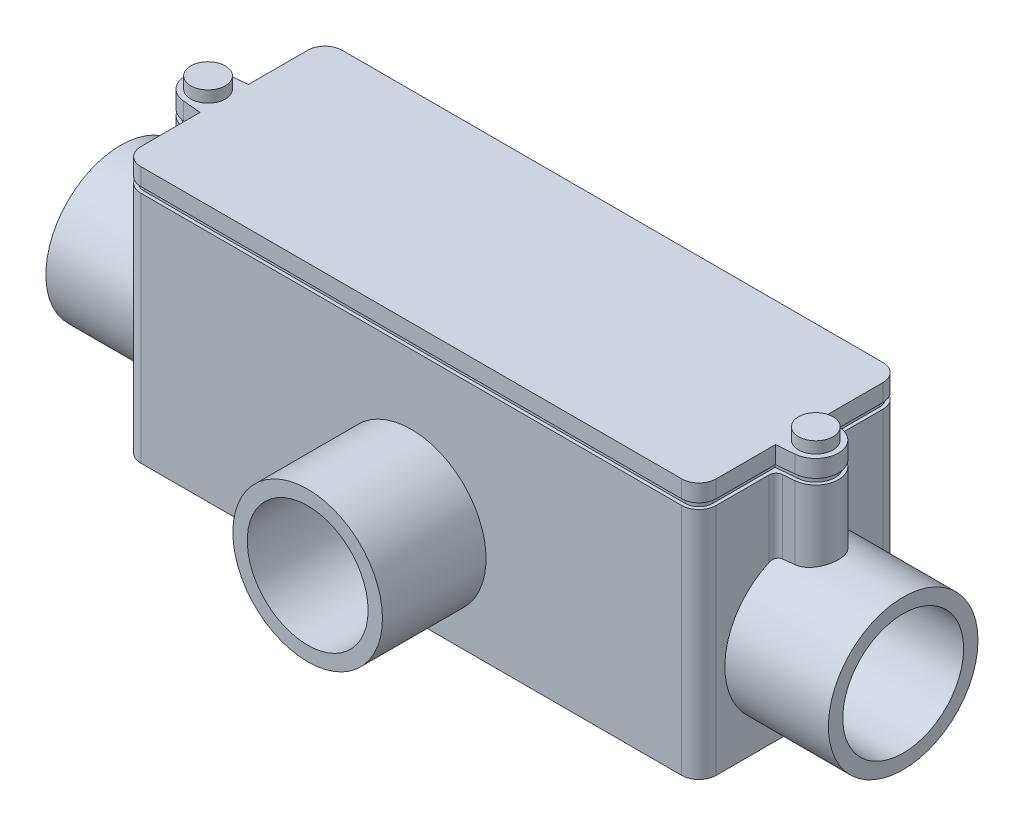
ISO-10303-21;
HEADER;
FILE_DESCRIPTION(('STEP AP214'),'2;1');
FILE_NAME('part.step','',(''),(''),'','','');
FILE_SCHEMA(('AUTOMOTIVE_DESIGN { 1 0 10303 214 1 1 1 1 }'));
ENDSEC;
DATA;
#1=APPLICATION_CONTEXT('core data for automotive mechanical design processes');
#2=APPLICATION_PROTOCOL_DEFINITION('international standard','automotive_design',2000,#1);
#3=PRODUCT_CONTEXT('',#1,'mechanical');
#4=PRODUCT('Part','Part','',(#3));
#5=PRODUCT_RELATED_PRODUCT_CATEGORY('part','',(#4));
#6=PRODUCT_DEFINITION_FORMATION('','',#4);
#7=PRODUCT_DEFINITION_CONTEXT('part definition',#1,'design');
#8=PRODUCT_DEFINITION('design','',#6,#7);
#9=PRODUCT_DEFINITION_SHAPE('','',#8);
#10=(LENGTH_UNIT() NAMED_UNIT(*) SI_UNIT(.MILLI.,.METRE.));
#11=(NAMED_UNIT(*) PLANE_ANGLE_UNIT() SI_UNIT($,.RADIAN.));
#12=(NAMED_UNIT(*) SI_UNIT($,.STERADIAN.) SOLID_ANGLE_UNIT());
#13=UNCERTAINTY_MEASURE_WITH_UNIT(LENGTH_MEASURE(1.E-05),#10,'distance_accuracy_value','');
#14=(GEOMETRIC_REPRESENTATION_CONTEXT(3) GLOBAL_UNCERTAINTY_ASSIGNED_CONTEXT((#13)) GLOBAL_UNIT_ASSIGNED_CONTEXT((#10,
#11,#12)) REPRESENTATION_CONTEXT('',''));
#15=CARTESIAN_POINT('',(0.,0.,0.));
#16=DIRECTION('',(0.,0.,1.));
#17=DIRECTION('',(1.,0.,0.));
#18=AXIS2_PLACEMENT_3D('',#15,#16,#17);
#19=CARTESIAN_POINT('',(59.69,56.6928,-18.415));
#20=DIRECTION('',(0.,1.,0.));
#21=DIRECTION('',(0.,0.,1.));
#22=AXIS2_PLACEMENT_3D('',#19,#20,#21);
#23=PLANE('',#22);
#24=CARTESIAN_POINT('',(-67.0687,56.6928,0.));
#25=DIRECTION('',(0.,1.,0.));
#26=DIRECTION('',(0.,0.,1.));
#27=AXIS2_PLACEMENT_3D('',#24,#25,#26);
#28=CIRCLE('',#27,3.81);
#29=CARTESIAN_POINT('',(-67.0687,56.6928,3.81000000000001));
#30=VERTEX_POINT('',#29);
#31=EDGE_CURVE('E1828',#30,#30,#28,.T.);
#32=ORIENTED_EDGE('',*,*,#31,.F.);
#33=EDGE_LOOP('',(#32));
#34=FACE_BOUND('',#33,.T.);
#35=CARTESIAN_POINT('',(59.69,56.6928,-18.415));
#36=DIRECTION('',(0.,1.,0.));
#37=DIRECTION('',(0.,0.,1.));
#38=AXIS2_PLACEMENT_3D('',#35,#36,#37);
#39=CIRCLE('',#38,3.81000000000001);
#40=CARTESIAN_POINT('',(63.5,56.6928,-18.415));
#41=VERTEX_POINT('',#40);
#42=CARTESIAN_POINT('',(59.69,56.6928,-22.225));
#43=VERTEX_POINT('',#42);
#44=EDGE_CURVE('E424',#41,#43,#39,.T.);
#45=ORIENTED_EDGE('',*,*,#44,.T.);
#46=DIRECTION('',(-1.,0.,0.));
#47=VECTOR('',#46,1.);
#48=CARTESIAN_POINT('',(59.69,56.6928,-22.225));
#49=LINE('',#48,#47);
#50=CARTESIAN_POINT('',(-59.69,56.6928,-22.225));
#51=VERTEX_POINT('',#50);
#52=EDGE_CURVE('E413',#43,#51,#49,.T.);
#53=ORIENTED_EDGE('',*,*,#52,.T.);
#54=CARTESIAN_POINT('',(-59.69,56.6928,-18.415));
#55=DIRECTION('',(0.,1.,0.));
#56=DIRECTION('',(0.,0.,1.));
#57=AXIS2_PLACEMENT_3D('',#54,#55,#56);
#58=CIRCLE('',#57,3.81);
#59=CARTESIAN_POINT('',(-63.5,56.6928,-18.415));
#60=VERTEX_POINT('',#59);
#61=EDGE_CURVE('E423',#51,#60,#58,.T.);
#62=ORIENTED_EDGE('',*,*,#61,.T.);
#63=DIRECTION('',(0.,0.,1.));
#64=VECTOR('',#63,1.);
#65=CARTESIAN_POINT('',(-63.5,56.6928,-18.415));
#66=LINE('',#65,#64);
#67=CARTESIAN_POINT('',(-63.5,56.6928,-5.33399999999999));
#68=VERTEX_POINT('',#67);
#69=EDGE_CURVE('E1837',#60,#68,#66,.T.);
#70=ORIENTED_EDGE('',*,*,#69,.T.);
#71=DIRECTION('',(-0.996136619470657,0.,0.0878170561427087));
#72=VECTOR('',#71,1.);
#73=CARTESIAN_POINT('',(-63.5,56.6928,-5.33399999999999));
#74=LINE('',#73,#72);
#75=CARTESIAN_POINT('',(-67.5077852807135,56.6928,-4.98068309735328));
#76=VERTEX_POINT('',#75);
#77=EDGE_CURVE('E1839',#68,#76,#74,.T.);
#78=ORIENTED_EDGE('',*,*,#77,.T.);
#79=CARTESIAN_POINT('',(-67.0687,56.6928,0.));
#80=DIRECTION('',(0.,1.,0.));
#81=DIRECTION('',(0.,0.,1.));
#82=AXIS2_PLACEMENT_3D('',#79,#80,#81);
#83=CIRCLE('',#82,5.);
#84=CARTESIAN_POINT('',(-67.5077852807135,56.6928,4.98068309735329));
#85=VERTEX_POINT('',#84);
#86=EDGE_CURVE('E1841',#76,#85,#83,.T.);
#87=ORIENTED_EDGE('',*,*,#86,.T.);
#88=DIRECTION('',(0.996136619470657,0.,0.0878170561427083));
#89=VECTOR('',#88,1.);
#90=CARTESIAN_POINT('',(-67.5077852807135,56.6928,4.98068309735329));
#91=LINE('',#90,#89);
#92=CARTESIAN_POINT('',(-63.5,56.6928,5.334));
#93=VERTEX_POINT('',#92);
#94=EDGE_CURVE('E1843',#85,#93,#91,.T.);
#95=ORIENTED_EDGE('',*,*,#94,.T.);
#96=DIRECTION('',(0.,0.,1.));
#97=VECTOR('',#96,1.);
#98=CARTESIAN_POINT('',(-63.5,56.6928,5.334));
#99=LINE('',#98,#97);
#100=CARTESIAN_POINT('',(-63.5,56.6928,18.415));
#101=VERTEX_POINT('',#100);
#102=EDGE_CURVE('E1845',#93,#101,#99,.T.);
#103=ORIENTED_EDGE('',*,*,#102,.T.);
#104=CARTESIAN_POINT('',(-59.69,56.6928,18.415));
#105=DIRECTION('',(0.,1.,0.));
#106=DIRECTION('',(0.,0.,1.));
#107=AXIS2_PLACEMENT_3D('',#104,#105,#106);
#108=CIRCLE('',#107,3.81);
#109=CARTESIAN_POINT('',(-59.69,56.6928,22.225));
#110=VERTEX_POINT('',#109);
#111=EDGE_CURVE('E1847',#101,#110,#108,.T.);
#112=ORIENTED_EDGE('',*,*,#111,.T.);
#113=DIRECTION('',(1.,0.,0.));
#114=VECTOR('',#113,1.);
#115=CARTESIAN_POINT('',(-59.69,56.6928,22.225));
#116=LINE('',#115,#114);
#117=CARTESIAN_POINT('',(59.69,56.6928,22.225));
#118=VERTEX_POINT('',#117);
#119=EDGE_CURVE('E1849',#110,#118,#116,.T.);
#120=ORIENTED_EDGE('',*,*,#119,.T.);
#121=CARTESIAN_POINT('',(59.69,56.6928,18.415));
#122=DIRECTION('',(0.,1.,0.));
#123=DIRECTION('',(0.,0.,1.));
#124=AXIS2_PLACEMENT_3D('',#121,#122,#123);
#125=CIRCLE('',#124,3.81);
#126=CARTESIAN_POINT('',(63.5,56.6928,18.415));
#127=VERTEX_POINT('',#126);
#128=EDGE_CURVE('E1851',#118,#127,#125,.T.);
#129=ORIENTED_EDGE('',*,*,#128,.T.);
#130=DIRECTION('',(0.,0.,-1.));
#131=VECTOR('',#130,1.);
#132=CARTESIAN_POINT('',(63.5,56.6928,18.415));
#133=LINE('',#132,#131);
#134=CARTESIAN_POINT('',(63.5,56.6928,5.33399999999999));
#135=VERTEX_POINT('',#134);
#136=EDGE_CURVE('E1853',#127,#135,#133,.T.);
#137=ORIENTED_EDGE('',*,*,#136,.T.);
#138=DIRECTION('',(0.996136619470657,0.,-0.0878170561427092));
#139=VECTOR('',#138,1.);
#140=CARTESIAN_POINT('',(63.5,56.6928,5.33399999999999));
#141=LINE('',#140,#139);
#142=CARTESIAN_POINT('',(67.5077852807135,56.6928,4.98068309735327));
#143=VERTEX_POINT('',#142);
#144=EDGE_CURVE('E1855',#135,#143,#141,.T.);
#145=ORIENTED_EDGE('',*,*,#144,.T.);
#146=CARTESIAN_POINT('',(67.0687,56.6928,0.));
#147=DIRECTION('',(0.,1.,0.));
#148=DIRECTION('',(0.,0.,1.));
#149=AXIS2_PLACEMENT_3D('',#146,#147,#148);
#150=CIRCLE('',#149,5.);
#151=CARTESIAN_POINT('',(67.5077852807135,56.6928,-4.98068309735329));
#152=VERTEX_POINT('',#151);
#153=EDGE_CURVE('E1857',#143,#152,#150,.T.);
#154=ORIENTED_EDGE('',*,*,#153,.T.);
#155=DIRECTION('',(-0.996136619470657,0.,-0.0878170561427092));
#156=VECTOR('',#155,1.);
#157=CARTESIAN_POINT('',(67.5077852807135,56.6928,-4.98068309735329));
#158=LINE('',#157,#156);
#159=CARTESIAN_POINT('',(63.5,56.6928,-5.33400000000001));
#160=VERTEX_POINT('',#159);
#161=EDGE_CURVE('E1859',#152,#160,#158,.T.);
#162=ORIENTED_EDGE('',*,*,#161,.T.);
#163=DIRECTION('',(0.,0.,-1.));
#164=VECTOR('',#163,1.);
#165=CARTESIAN_POINT('',(63.5,56.6928,-5.33400000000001));
#166=LINE('',#165,#164);
#167=EDGE_CURVE('E429',#160,#41,#166,.T.);
#168=ORIENTED_EDGE('',*,*,#167,.T.);
#169=EDGE_LOOP('',(#45,#53,#62,#70,#78,#87,#95,#103,#112,#120,#129,#137,#145,#154,#162,#168));
#170=FACE_BOUND('',#169,.T.);
#171=CARTESIAN_POINT('',(67.0687,56.6928,0.));
#172=DIRECTION('',(0.,1.,0.));
#173=DIRECTION('',(0.,0.,1.));
#174=AXIS2_PLACEMENT_3D('',#171,#172,#173);
#175=CIRCLE('',#174,3.81);
#176=CARTESIAN_POINT('',(67.0687,56.6928,3.80999999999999));
#177=VERTEX_POINT('',#176);
#178=EDGE_CURVE('E1826',#177,#177,#175,.T.);
#179=ORIENTED_EDGE('',*,*,#178,.F.);
#180=EDGE_LOOP('',(#179));
#181=FACE_BOUND('',#180,.T.);
#182=ADVANCED_FACE('F36',(#34,#170,#181),#23,.T.);
#183=CARTESIAN_POINT('',(0.,51.6128,0.));
#184=DIRECTION('',(0.,1.,0.));
#185=DIRECTION('',(0.,0.,1.));
#186=AXIS2_PLACEMENT_3D('',#183,#184,#185);
#187=PLANE('',#186);
#188=DIRECTION('',(0.,0.,1.));
#189=VECTOR('',#188,1.);
#190=CARTESIAN_POINT('',(-63.5,51.6128,-22.225));
#191=LINE('',#190,#189);
#192=CARTESIAN_POINT('',(-63.5,51.6128,-18.415));
#193=VERTEX_POINT('',#192);
#194=CARTESIAN_POINT('',(-63.5,51.6128,-6.72955837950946));
#195=VERTEX_POINT('',#194);
#196=EDGE_CURVE('E1041',#193,#195,#191,.T.);
#197=ORIENTED_EDGE('',*,*,#196,.T.);
#198=CARTESIAN_POINT('',(-65.024,51.6128,-6.72955837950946));
#199=DIRECTION('',(0.,1.,0.));
#200=DIRECTION('',(0.,0.,1.));
#201=AXIS2_PLACEMENT_3D('',#198,#199,#200);
#202=CIRCLE('',#201,1.524);
#203=CARTESIAN_POINT('',(-64.8901668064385,51.6128,-5.21144617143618));
#204=VERTEX_POINT('',#203);
#205=EDGE_CURVE('E45',#195,#204,#202,.F.);
#206=ORIENTED_EDGE('',*,*,#205,.T.);
#207=DIRECTION('',(-0.996136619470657,0.,0.087817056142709));
#208=VECTOR('',#207,1.);
#209=CARTESIAN_POINT('',(-63.5,51.6128,-5.33399999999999));
#210=LINE('',#209,#208);
#211=CARTESIAN_POINT('',(-67.5077852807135,51.6128,-4.98068309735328));
#212=VERTEX_POINT('',#211);
#213=EDGE_CURVE('E1157',#204,#212,#210,.T.);
#214=ORIENTED_EDGE('',*,*,#213,.T.);
#215=CARTESIAN_POINT('',(-67.0687,51.6128,0.));
#216=DIRECTION('',(0.,1.,0.));
#217=DIRECTION('',(0.,0.,-1.));
#218=AXIS2_PLACEMENT_3D('',#215,#216,#217);
#219=CIRCLE('',#218,5.);
#220=CARTESIAN_POINT('',(-67.5077852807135,51.6128,4.98068309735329));
#221=VERTEX_POINT('',#220);
#222=EDGE_CURVE('E1159',#212,#221,#219,.T.);
#223=ORIENTED_EDGE('',*,*,#222,.T.);
#224=DIRECTION('',(0.996136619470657,0.,0.0878170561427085));
#225=VECTOR('',#224,1.);
#226=CARTESIAN_POINT('',(-63.5,51.6128,5.33400000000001));
#227=LINE('',#226,#225);
#228=CARTESIAN_POINT('',(-64.8901668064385,51.6128,5.2114461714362));
#229=VERTEX_POINT('',#228);
#230=EDGE_CURVE('E1162',#221,#229,#227,.T.);
#231=ORIENTED_EDGE('',*,*,#230,.T.);
#232=CARTESIAN_POINT('',(-65.024,51.6128,6.72955837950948));
#233=DIRECTION('',(0.,1.,0.));
#234=DIRECTION('',(0.,0.,1.));
#235=AXIS2_PLACEMENT_3D('',#232,#233,#234);
#236=CIRCLE('',#235,1.524);
#237=CARTESIAN_POINT('',(-63.5,51.6128,6.72955837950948));
#238=VERTEX_POINT('',#237);
#239=EDGE_CURVE('E11',#229,#238,#236,.F.);
#240=ORIENTED_EDGE('',*,*,#239,.T.);
#241=CARTESIAN_POINT('',(-63.5,51.6128,18.415));
#242=VERTEX_POINT('',#241);
#243=EDGE_CURVE('E1044',#238,#242,#191,.T.);
#244=ORIENTED_EDGE('',*,*,#243,.T.);
#245=CARTESIAN_POINT('',(-59.69,51.6128,18.415));
#246=DIRECTION('',(0.,1.,0.));
#247=DIRECTION('',(0.,0.,1.));
#248=AXIS2_PLACEMENT_3D('',#245,#246,#247);
#249=CIRCLE('',#248,3.81);
#250=CARTESIAN_POINT('',(-59.69,51.6128,22.225));
#251=VERTEX_POINT('',#250);
#252=EDGE_CURVE('E1089',#242,#251,#249,.T.);
#253=ORIENTED_EDGE('',*,*,#252,.T.);
#254=DIRECTION('',(1.,0.,0.));
#255=VECTOR('',#254,1.);
#256=CARTESIAN_POINT('',(-63.5,51.6128,22.225));
#257=LINE('',#256,#255);
#258=CARTESIAN_POINT('',(59.69,51.6128,22.225));
#259=VERTEX_POINT('',#258);
#260=EDGE_CURVE('E1043',#251,#259,#257,.T.);
#261=ORIENTED_EDGE('',*,*,#260,.T.);
#262=CARTESIAN_POINT('',(59.69,51.6128,18.415));
#263=DIRECTION('',(0.,1.,0.));
#264=DIRECTION('',(0.,0.,1.));
#265=AXIS2_PLACEMENT_3D('',#262,#263,#264);
#266=CIRCLE('',#265,3.81);
#267=CARTESIAN_POINT('',(63.5,51.6128,18.415));
#268=VERTEX_POINT('',#267);
#269=EDGE_CURVE('E1087',#259,#268,#266,.T.);
#270=ORIENTED_EDGE('',*,*,#269,.T.);
#271=DIRECTION('',(0.,0.,-1.));
#272=VECTOR('',#271,1.);
#273=CARTESIAN_POINT('',(63.5,51.6128,-22.225));
#274=LINE('',#273,#272);
#275=CARTESIAN_POINT('',(63.5,51.6128,6.72955837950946));
#276=VERTEX_POINT('',#275);
#277=EDGE_CURVE('E1048',#268,#276,#274,.T.);
#278=ORIENTED_EDGE('',*,*,#277,.T.);
#279=CARTESIAN_POINT('',(65.024,51.6128,6.72955837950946));
#280=DIRECTION('',(0.,1.,0.));
#281=DIRECTION('',(0.,0.,1.));
#282=AXIS2_PLACEMENT_3D('',#279,#280,#281);
#283=CIRCLE('',#282,1.524);
#284=CARTESIAN_POINT('',(64.8901668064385,51.6128,5.21144617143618));
#285=VERTEX_POINT('',#284);
#286=EDGE_CURVE('E947',#276,#285,#283,.F.);
#287=ORIENTED_EDGE('',*,*,#286,.T.);
#288=DIRECTION('',(0.996136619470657,0.,-0.0878170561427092));
#289=VECTOR('',#288,1.);
#290=CARTESIAN_POINT('',(63.5,51.6128,5.33399999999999));
#291=LINE('',#290,#289);
#292=CARTESIAN_POINT('',(67.5077852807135,51.6128,4.98068309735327));
#293=VERTEX_POINT('',#292);
#294=EDGE_CURVE('E956',#285,#293,#291,.T.);
#295=ORIENTED_EDGE('',*,*,#294,.T.);
#296=CARTESIAN_POINT('',(67.0687,51.6128,0.));
#297=DIRECTION('',(0.,1.,0.));
#298=DIRECTION('',(0.,0.,1.));
#299=AXIS2_PLACEMENT_3D('',#296,#297,#298);
#300=CIRCLE('',#299,5.);
#301=CARTESIAN_POINT('',(67.5077852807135,51.6128,-4.98068309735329));
#302=VERTEX_POINT('',#301);
#303=EDGE_CURVE('E964',#293,#302,#300,.T.);
#304=ORIENTED_EDGE('',*,*,#303,.T.);
#305=DIRECTION('',(-0.996136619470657,0.,-0.0878170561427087));
#306=VECTOR('',#305,1.);
#307=CARTESIAN_POINT('',(63.5,51.6128,-5.33400000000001));
#308=LINE('',#307,#306);
#309=CARTESIAN_POINT('',(64.8901668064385,51.6128,-5.2114461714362));
#310=VERTEX_POINT('',#309);
#311=EDGE_CURVE('E961',#302,#310,#308,.T.);
#312=ORIENTED_EDGE('',*,*,#311,.T.);
#313=CARTESIAN_POINT('',(65.024,51.6128,-6.72955837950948));
#314=DIRECTION('',(0.,1.,0.));
#315=DIRECTION('',(0.,0.,1.));
#316=AXIS2_PLACEMENT_3D('',#313,#314,#315);
#317=CIRCLE('',#316,1.524);
#318=CARTESIAN_POINT('',(63.5,51.6128,-6.72955837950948));
#319=VERTEX_POINT('',#318);
#320=EDGE_CURVE('E1168',#310,#319,#317,.F.);
#321=ORIENTED_EDGE('',*,*,#320,.T.);
#322=CARTESIAN_POINT('',(63.5,51.6128,-18.415));
#323=VERTEX_POINT('',#322);
#324=EDGE_CURVE('E1047',#319,#323,#274,.T.);
#325=ORIENTED_EDGE('',*,*,#324,.T.);
#326=CARTESIAN_POINT('',(59.69,51.6128,-18.415));
#327=DIRECTION('',(0.,1.,0.));
#328=DIRECTION('',(0.,0.,1.));
#329=AXIS2_PLACEMENT_3D('',#326,#327,#328);
#330=CIRCLE('',#329,3.81);
#331=CARTESIAN_POINT('',(59.69,51.6128,-22.225));
#332=VERTEX_POINT('',#331);
#333=EDGE_CURVE('E1085',#323,#332,#330,.T.);
#334=ORIENTED_EDGE('',*,*,#333,.T.);
#335=DIRECTION('',(-1.,0.,0.));
#336=VECTOR('',#335,1.);
#337=CARTESIAN_POINT('',(-63.5,51.6128,-22.225));
#338=LINE('',#337,#336);
#339=CARTESIAN_POINT('',(-59.69,51.6128,-22.225));
#340=VERTEX_POINT('',#339);
#341=EDGE_CURVE('E1050',#332,#340,#338,.T.);
#342=ORIENTED_EDGE('',*,*,#341,.T.);
#343=CARTESIAN_POINT('',(-59.69,51.6128,-18.415));
#344=DIRECTION('',(0.,1.,0.));
#345=DIRECTION('',(0.,0.,1.));
#346=AXIS2_PLACEMENT_3D('',#343,#344,#345);
#347=CIRCLE('',#346,3.81);
#348=EDGE_CURVE('E1083',#340,#193,#347,.T.);
#349=ORIENTED_EDGE('',*,*,#348,.T.);
#350=EDGE_LOOP('',(#197,#206,#214,#223,#231,#240,#244,#253,#261,#270,#278,#287,#295,#304,#312,
#321,#325,#334,#342,#349));
#351=FACE_BOUND('',#350,.T.);
#352=DIRECTION('',(1.,0.,0.));
#353=VECTOR('',#352,1.);
#354=CARTESIAN_POINT('',(-59.69,51.6128,21.463));
#355=LINE('',#354,#353);
#356=CARTESIAN_POINT('',(-59.69,51.6128,21.463));
#357=VERTEX_POINT('',#356);
#358=CARTESIAN_POINT('',(59.69,51.6128,21.463));
#359=VERTEX_POINT('',#358);
#360=EDGE_CURVE('E441',#357,#359,#355,.T.);
#361=ORIENTED_EDGE('',*,*,#360,.F.);
#362=CARTESIAN_POINT('',(-59.69,51.6128,18.415));
#363=DIRECTION('',(0.,1.,0.));
#364=DIRECTION('',(0.,0.,1.));
#365=AXIS2_PLACEMENT_3D('',#362,#363,#364);
#366=CIRCLE('',#365,3.048);
#367=CARTESIAN_POINT('',(-62.738,51.6128,18.415));
#368=VERTEX_POINT('',#367);
#369=EDGE_CURVE('E438',#368,#357,#366,.T.);
#370=ORIENTED_EDGE('',*,*,#369,.F.);
#371=DIRECTION('',(0.,0.,1.));
#372=VECTOR('',#371,1.);
#373=CARTESIAN_POINT('',(-62.738,51.6128,4.63622081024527));
#374=LINE('',#373,#372);
#375=CARTESIAN_POINT('',(-62.738,51.6128,4.63622081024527));
#376=VERTEX_POINT('',#375);
#377=EDGE_CURVE('E451',#376,#368,#374,.T.);
#378=ORIENTED_EDGE('',*,*,#377,.F.);
#379=DIRECTION('',(0.996136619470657,0.,0.0878170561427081));
#380=VECTOR('',#379,1.);
#381=CARTESIAN_POINT('',(-67.4408686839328,51.6128,4.22162699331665));
#382=LINE('',#381,#380);
#383=CARTESIAN_POINT('',(-67.4408686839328,51.6128,4.22162699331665));
#384=VERTEX_POINT('',#383);
#385=EDGE_CURVE('E522',#384,#376,#382,.T.);
#386=ORIENTED_EDGE('',*,*,#385,.F.);
#387=CARTESIAN_POINT('',(-67.0687,51.6128,0.));
#388=DIRECTION('',(0.,1.,0.));
#389=DIRECTION('',(0.,0.,1.));
#390=AXIS2_PLACEMENT_3D('',#387,#388,#389);
#391=CIRCLE('',#390,4.238);
#392=CARTESIAN_POINT('',(-67.4408686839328,51.6128,-4.22162699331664));
#393=VERTEX_POINT('',#392);
#394=EDGE_CURVE('E520',#393,#384,#391,.T.);
#395=ORIENTED_EDGE('',*,*,#394,.F.);
#396=DIRECTION('',(-0.996136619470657,0.,0.0878170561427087));
#397=VECTOR('',#396,1.);
#398=CARTESIAN_POINT('',(-62.738,51.6128,-4.63622081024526));
#399=LINE('',#398,#397);
#400=CARTESIAN_POINT('',(-62.738,51.6128,-4.63622081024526));
#401=VERTEX_POINT('',#400);
#402=EDGE_CURVE('E518',#401,#393,#399,.T.);
#403=ORIENTED_EDGE('',*,*,#402,.F.);
#404=DIRECTION('',(0.,0.,1.));
#405=VECTOR('',#404,1.);
#406=CARTESIAN_POINT('',(-62.738,51.6128,-18.415));
#407=LINE('',#406,#405);
#408=CARTESIAN_POINT('',(-62.738,51.6128,-18.415));
#409=VERTEX_POINT('',#408);
#410=EDGE_CURVE('E516',#409,#401,#407,.T.);
#411=ORIENTED_EDGE('',*,*,#410,.F.);
#412=CARTESIAN_POINT('',(-59.69,51.6128,-18.415));
#413=DIRECTION('',(0.,1.,0.));
#414=DIRECTION('',(0.,0.,1.));
#415=AXIS2_PLACEMENT_3D('',#412,#413,#414);
#416=CIRCLE('',#415,3.048);
#417=CARTESIAN_POINT('',(-59.69,51.6128,-21.463));
#418=VERTEX_POINT('',#417);
#419=EDGE_CURVE('E514',#418,#409,#416,.T.);
#420=ORIENTED_EDGE('',*,*,#419,.F.);
#421=DIRECTION('',(-1.,0.,0.));
#422=VECTOR('',#421,1.);
#423=CARTESIAN_POINT('',(59.69,51.6128,-21.463));
#424=LINE('',#423,#422);
#425=CARTESIAN_POINT('',(59.69,51.6128,-21.463));
#426=VERTEX_POINT('',#425);
#427=EDGE_CURVE('E512',#426,#418,#424,.T.);
#428=ORIENTED_EDGE('',*,*,#427,.F.);
#429=CARTESIAN_POINT('',(59.69,51.6128,-18.415));
#430=DIRECTION('',(0.,1.,0.));
#431=DIRECTION('',(0.,0.,1.));
#432=AXIS2_PLACEMENT_3D('',#429,#430,#431);
#433=CIRCLE('',#432,3.04800000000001);
#434=CARTESIAN_POINT('',(62.738,51.6128,-18.415));
#435=VERTEX_POINT('',#434);
#436=EDGE_CURVE('E510',#435,#426,#433,.T.);
#437=ORIENTED_EDGE('',*,*,#436,.F.);
#438=DIRECTION('',(0.,0.,-1.));
#439=VECTOR('',#438,1.);
#440=CARTESIAN_POINT('',(62.738,51.6128,-4.63622081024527));
#441=LINE('',#440,#439);
#442=CARTESIAN_POINT('',(62.738,51.6128,-4.63622081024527));
#443=VERTEX_POINT('',#442);
#444=EDGE_CURVE('E508',#443,#435,#441,.T.);
#445=ORIENTED_EDGE('',*,*,#444,.F.);
#446=DIRECTION('',(-0.996136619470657,0.,-0.0878170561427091));
#447=VECTOR('',#446,1.);
#448=CARTESIAN_POINT('',(67.4408686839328,51.6128,-4.22162699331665));
#449=LINE('',#448,#447);
#450=CARTESIAN_POINT('',(67.4408686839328,51.6128,-4.22162699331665));
#451=VERTEX_POINT('',#450);
#452=EDGE_CURVE('E506',#451,#443,#449,.T.);
#453=ORIENTED_EDGE('',*,*,#452,.F.);
#454=CARTESIAN_POINT('',(67.0687,51.6128,0.));
#455=DIRECTION('',(0.,1.,0.));
#456=DIRECTION('',(0.,0.,1.));
#457=AXIS2_PLACEMENT_3D('',#454,#455,#456);
#458=CIRCLE('',#457,4.238);
#459=CARTESIAN_POINT('',(67.4408686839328,51.6128,4.22162699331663));
#460=VERTEX_POINT('',#459);
#461=EDGE_CURVE('E504',#460,#451,#458,.T.);
#462=ORIENTED_EDGE('',*,*,#461,.F.);
#463=DIRECTION('',(0.996136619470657,0.,-0.0878170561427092));
#464=VECTOR('',#463,1.);
#465=CARTESIAN_POINT('',(62.738,51.6128,4.63622081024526));
#466=LINE('',#465,#464);
#467=CARTESIAN_POINT('',(62.738,51.6128,4.63622081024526));
#468=VERTEX_POINT('',#467);
#469=EDGE_CURVE('E502',#468,#460,#466,.T.);
#470=ORIENTED_EDGE('',*,*,#469,.F.);
#471=DIRECTION('',(0.,0.,-1.));
#472=VECTOR('',#471,1.);
#473=CARTESIAN_POINT('',(62.738,51.6128,18.415));
#474=LINE('',#473,#472);
#475=CARTESIAN_POINT('',(62.738,51.6128,18.415));
#476=VERTEX_POINT('',#475);
#477=EDGE_CURVE('E500',#476,#468,#474,.T.);
#478=ORIENTED_EDGE('',*,*,#477,.F.);
#479=CARTESIAN_POINT('',(59.69,51.6128,18.415));
#480=DIRECTION('',(0.,1.,0.));
#481=DIRECTION('',(0.,0.,1.));
#482=AXIS2_PLACEMENT_3D('',#479,#480,#481);
#483=CIRCLE('',#482,3.048);
#484=EDGE_CURVE('E498',#359,#476,#483,.T.);
#485=ORIENTED_EDGE('',*,*,#484,.F.);
#486=EDGE_LOOP('',(#361,#370,#378,#386,#395,#403,#411,#420,#428,#437,#445,#453,#462,#470,#478,#485));
#487=FACE_BOUND('',#486,.T.);
#488=ADVANCED_FACE('F722',(#351,#487),#187,.T.);
#489=CARTESIAN_POINT('',(-59.944,51.6128,-22.225));
#490=DIRECTION('',(1.,0.,0.));
#491=DIRECTION('',(0.,0.,-1.));
#492=AXIS2_PLACEMENT_3D('',#489,#490,#491);
#493=PLANE('',#492);
#494=DIRECTION('',(0.,0.,1.));
#495=VECTOR('',#494,1.);
#496=CARTESIAN_POINT('',(-59.944,3.556,-22.225));
#497=LINE('',#496,#495);
#498=CARTESIAN_POINT('',(-59.944,3.556,-18.415));
#499=VERTEX_POINT('',#498);
#500=CARTESIAN_POINT('',(-59.944,3.556,18.415));
#501=VERTEX_POINT('',#500);
#502=EDGE_CURVE('E972',#499,#501,#497,.T.);
#503=ORIENTED_EDGE('',*,*,#502,.F.);
#504=DIRECTION('',(0.,1.,0.));
#505=VECTOR('',#504,1.);
#506=CARTESIAN_POINT('',(-59.944,51.6128,-18.415));
#507=LINE('',#506,#505);
#508=CARTESIAN_POINT('',(-59.944,51.6128,-18.415));
#509=VERTEX_POINT('',#508);
#510=EDGE_CURVE('E980',#509,#499,#507,.F.);
#511=ORIENTED_EDGE('',*,*,#510,.F.);
#512=DIRECTION('',(0.,0.,1.));
#513=VECTOR('',#512,1.);
#514=CARTESIAN_POINT('',(-59.944,51.6128,-22.225));
#515=LINE('',#514,#513);
#516=CARTESIAN_POINT('',(-59.944,51.6128,18.415));
#517=VERTEX_POINT('',#516);
#518=EDGE_CURVE('E996',#509,#517,#515,.T.);
#519=ORIENTED_EDGE('',*,*,#518,.T.);
#520=DIRECTION('',(0.,1.,0.));
#521=VECTOR('',#520,1.);
#522=CARTESIAN_POINT('',(-59.944,51.6128,18.415));
#523=LINE('',#522,#521);
#524=EDGE_CURVE('E976',#501,#517,#523,.T.);
#525=ORIENTED_EDGE('',*,*,#524,.F.);
#526=EDGE_LOOP('',(#503,#511,#519,#525));
#527=FACE_BOUND('',#526,.T.);
#528=CARTESIAN_POINT('',(-59.944,19.812,0.));
#529=DIRECTION('',(1.,0.,0.));
#530=DIRECTION('',(0.,0.,-1.));
#531=AXIS2_PLACEMENT_3D('',#528,#529,#530);
#532=CIRCLE('',#531,10.795);
#533=CARTESIAN_POINT('',(-59.944,19.812,-10.795));
#534=VERTEX_POINT('',#533);
#535=EDGE_CURVE('E584',#534,#534,#532,.F.);
#536=ORIENTED_EDGE('',*,*,#535,.T.);
#537=EDGE_LOOP('',(#536));
#538=FACE_BOUND('',#537,.T.);
#539=ADVANCED_FACE('F679',(#527,#538),#493,.T.);
#540=CARTESIAN_POINT('',(-66.5226,19.812,0.));
#541=DIRECTION('',(-1.,0.,0.));
#542=DIRECTION('',(0.,0.,-1.));
#543=AXIS2_PLACEMENT_3D('',#540,#541,#542);
#544=PLANE('',#543);
#545=CARTESIAN_POINT('',(-66.5226,19.812,0.));
#546=DIRECTION('',(1.,0.,0.));
#547=DIRECTION('',(0.,0.,-1.));
#548=AXIS2_PLACEMENT_3D('',#545,#546,#547);
#549=CIRCLE('',#548,13.335);
#550=CARTESIAN_POINT('',(-66.5226,19.812,-13.335));
#551=VERTEX_POINT('',#550);
#552=EDGE_CURVE('E588',#551,#551,#549,.T.);
#553=ORIENTED_EDGE('',*,*,#552,.F.);
#554=EDGE_LOOP('',(#553));
#555=FACE_BOUND('',#554,.T.);
#556=CARTESIAN_POINT('',(-66.5226,19.812,0.));
#557=DIRECTION('',(1.,0.,0.));
#558=DIRECTION('',(0.,0.,-1.));
#559=AXIS2_PLACEMENT_3D('',#556,#557,#558);
#560=CIRCLE('',#559,10.795);
#561=CARTESIAN_POINT('',(-66.5226,19.812,-10.795));
#562=VERTEX_POINT('',#561);
#563=EDGE_CURVE('E579',#562,#562,#560,.T.);
#564=ORIENTED_EDGE('',*,*,#563,.T.);
#565=EDGE_LOOP('',(#564));
#566=FACE_BOUND('',#565,.T.);
#567=ADVANCED_FACE('F882',(#555,#566),#544,.T.);
#568=CARTESIAN_POINT('',(-86.36,19.812,0.));
#569=DIRECTION('',(-1.,0.,0.));
#570=DIRECTION('',(0.,0.,-1.));
#571=AXIS2_PLACEMENT_3D('',#568,#569,#570);
#572=PLANE('',#571);
#573=CARTESIAN_POINT('',(-86.36,19.812,0.));
#574=DIRECTION('',(1.,0.,0.));
#575=DIRECTION('',(0.,0.,-1.));
#576=AXIS2_PLACEMENT_3D('',#573,#574,#575);
#577=CIRCLE('',#576,16.51);
#578=CARTESIAN_POINT('',(-86.36,19.812,-16.51));
#579=VERTEX_POINT('',#578);
#580=EDGE_CURVE('E594',#579,#579,#577,.T.);
#581=ORIENTED_EDGE('',*,*,#580,.F.);
#582=EDGE_LOOP('',(#581));
#583=FACE_BOUND('',#582,.T.);
#584=CARTESIAN_POINT('',(-86.36,19.812,0.));
#585=DIRECTION('',(1.,0.,0.));
#586=DIRECTION('',(0.,0.,-1.));
#587=AXIS2_PLACEMENT_3D('',#584,#585,#586);
#588=CIRCLE('',#587,13.335);
#589=CARTESIAN_POINT('',(-86.36,19.812,-13.335));
#590=VERTEX_POINT('',#589);
#591=EDGE_CURVE('E587',#590,#590,#588,.T.);
#592=ORIENTED_EDGE('',*,*,#591,.T.);
#593=EDGE_LOOP('',(#592));
#594=FACE_BOUND('',#593,.T.);
#595=ADVANCED_FACE('F621',(#583,#594),#572,.T.);
#596=CARTESIAN_POINT('',(-63.5,51.6128,22.225));
#597=DIRECTION('',(0.,0.,-1.));
#598=DIRECTION('',(-1.,0.,0.));
#599=AXIS2_PLACEMENT_3D('',#596,#597,#598);
#600=PLANE('',#599);
#601=ORIENTED_EDGE('',*,*,#260,.F.);
#602=DIRECTION('',(0.,-1.,0.));
#603=VECTOR('',#602,1.);
#604=CARTESIAN_POINT('',(-59.69,51.6128,22.225));
#605=LINE('',#604,#603);
#606=CARTESIAN_POINT('',(-59.69,0.,22.225));
#607=VERTEX_POINT('',#606);
#608=EDGE_CURVE('E1066',#251,#607,#605,.T.);
#609=ORIENTED_EDGE('',*,*,#608,.T.);
#610=DIRECTION('',(1.,0.,0.));
#611=VECTOR('',#610,1.);
#612=CARTESIAN_POINT('',(-63.5,0.,22.225));
#613=LINE('',#612,#611);
#614=CARTESIAN_POINT('',(59.69,0.,22.225));
#615=VERTEX_POINT('',#614);
#616=EDGE_CURVE('E1056',#607,#615,#613,.T.);
#617=ORIENTED_EDGE('',*,*,#616,.T.);
#618=DIRECTION('',(0.,-1.,0.));
#619=VECTOR('',#618,1.);
#620=CARTESIAN_POINT('',(59.69,51.6128,22.225));
#621=LINE('',#620,#619);
#622=EDGE_CURVE('E1053',#615,#259,#621,.F.);
#623=ORIENTED_EDGE('',*,*,#622,.T.);
#624=EDGE_LOOP('',(#601,#609,#617,#623));
#625=FACE_BOUND('',#624,.T.);
#626=CARTESIAN_POINT('',(0.,19.812,22.225));
#627=DIRECTION('',(0.,0.,-1.));
#628=DIRECTION('',(-1.,0.,0.));
#629=AXIS2_PLACEMENT_3D('',#626,#627,#628);
#630=CIRCLE('',#629,16.51);
#631=CARTESIAN_POINT('',(-16.51,19.812,22.225));
#632=VERTEX_POINT('',#631);
#633=EDGE_CURVE('E912',#632,#632,#630,.F.);
#634=ORIENTED_EDGE('',*,*,#633,.F.);
#635=EDGE_LOOP('',(#634));
#636=FACE_BOUND('',#635,.T.);
#637=ADVANCED_FACE('F894',(#625,#636),#600,.F.);
#638=CARTESIAN_POINT('',(63.5,51.6128,-22.225));
#639=DIRECTION('',(-1.,0.,0.));
#640=DIRECTION('',(0.,0.,1.));
#641=AXIS2_PLACEMENT_3D('',#638,#639,#640);
#642=PLANE('',#641);
#643=CARTESIAN_POINT('',(63.5,19.812,0.));
#644=DIRECTION('',(-1.,0.,0.));
#645=DIRECTION('',(0.,0.,1.));
#646=AXIS2_PLACEMENT_3D('',#643,#644,#645);
#647=CIRCLE('',#646,16.51);
#648=CARTESIAN_POINT('',(63.5,34.8882443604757,6.72955837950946));
#649=VERTEX_POINT('',#648);
#650=CARTESIAN_POINT('',(63.5,34.8882443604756,-6.72955837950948));
#651=VERTEX_POINT('',#650);
#652=EDGE_CURVE('E934',#649,#651,#647,.F.);
#653=ORIENTED_EDGE('',*,*,#652,.F.);
#654=DIRECTION('',(0.,1.,0.));
#655=VECTOR('',#654,1.);
#656=CARTESIAN_POINT('',(63.5,51.6128,6.72955837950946));
#657=LINE('',#656,#655);
#658=EDGE_CURVE('E942',#649,#276,#657,.T.);
#659=ORIENTED_EDGE('',*,*,#658,.T.);
#660=ORIENTED_EDGE('',*,*,#277,.F.);
#661=DIRECTION('',(0.,-1.,0.));
#662=VECTOR('',#661,1.);
#663=CARTESIAN_POINT('',(63.5,51.6128,18.415));
#664=LINE('',#663,#662);
#665=CARTESIAN_POINT('',(63.5,0.,18.415));
#666=VERTEX_POINT('',#665);
#667=EDGE_CURVE('E1094',#268,#666,#664,.T.);
#668=ORIENTED_EDGE('',*,*,#667,.T.);
#669=DIRECTION('',(0.,0.,-1.));
#670=VECTOR('',#669,1.);
#671=CARTESIAN_POINT('',(63.5,0.,-22.225));
#672=LINE('',#671,#670);
#673=CARTESIAN_POINT('',(63.5,0.,-18.415));
#674=VERTEX_POINT('',#673);
#675=EDGE_CURVE('E1059',#666,#674,#672,.T.);
#676=ORIENTED_EDGE('',*,*,#675,.T.);
#677=DIRECTION('',(0.,-1.,0.));
#678=VECTOR('',#677,1.);
#679=CARTESIAN_POINT('',(63.5,51.6128,-18.415));
#680=LINE('',#679,#678);
#681=EDGE_CURVE('E1091',#674,#323,#680,.F.);
#682=ORIENTED_EDGE('',*,*,#681,.T.);
#683=ORIENTED_EDGE('',*,*,#324,.F.);
#684=DIRECTION('',(0.,1.,0.));
#685=VECTOR('',#684,1.);
#686=CARTESIAN_POINT('',(63.5,51.6128,-6.72955837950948));
#687=LINE('',#686,#685);
#688=EDGE_CURVE('E911',#319,#651,#687,.F.);
#689=ORIENTED_EDGE('',*,*,#688,.T.);
#690=EDGE_LOOP('',(#653,#659,#660,#668,#676,#682,#683,#689));
#691=FACE_BOUND('',#690,.T.);
#692=ADVANCED_FACE('F899',(#691),#642,.F.);
#693=CARTESIAN_POINT('',(-63.5,51.6128,-22.225));
#694=DIRECTION('',(1.,0.,0.));
#695=DIRECTION('',(0.,0.,-1.));
#696=AXIS2_PLACEMENT_3D('',#693,#694,#695);
#697=PLANE('',#696);
#698=CARTESIAN_POINT('',(-63.5,19.812,0.));
#699=DIRECTION('',(1.,0.,0.));
#700=DIRECTION('',(0.,0.,-1.));
#701=AXIS2_PLACEMENT_3D('',#698,#699,#700);
#702=CIRCLE('',#701,16.51);
#703=CARTESIAN_POINT('',(-63.5,34.8882443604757,6.72955837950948));
#704=VERTEX_POINT('',#703);
#705=CARTESIAN_POINT('',(-63.5,34.8882443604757,-6.72955837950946));
#706=VERTEX_POINT('',#705);
#707=EDGE_CURVE('E591',#704,#706,#702,.T.);
#708=ORIENTED_EDGE('',*,*,#707,.T.);
#709=DIRECTION('',(0.,1.,0.));
#710=VECTOR('',#709,1.);
#711=CARTESIAN_POINT('',(-63.5,51.6128,-6.72955837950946));
#712=LINE('',#711,#710);
#713=EDGE_CURVE('E917',#706,#195,#712,.T.);
#714=ORIENTED_EDGE('',*,*,#713,.T.);
#715=ORIENTED_EDGE('',*,*,#196,.F.);
#716=DIRECTION('',(0.,-1.,0.));
#717=VECTOR('',#716,1.);
#718=CARTESIAN_POINT('',(-63.5,51.6128,-18.415));
#719=LINE('',#718,#717);
#720=CARTESIAN_POINT('',(-63.5,0.,-18.415));
#721=VERTEX_POINT('',#720);
#722=EDGE_CURVE('E1077',#193,#721,#719,.T.);
#723=ORIENTED_EDGE('',*,*,#722,.T.);
#724=DIRECTION('',(0.,0.,1.));
#725=VECTOR('',#724,1.);
#726=CARTESIAN_POINT('',(-63.5,0.,-22.225));
#727=LINE('',#726,#725);
#728=CARTESIAN_POINT('',(-63.5,0.,18.415));
#729=VERTEX_POINT('',#728);
#730=EDGE_CURVE('E1018',#721,#729,#727,.T.);
#731=ORIENTED_EDGE('',*,*,#730,.T.);
#732=DIRECTION('',(0.,-1.,0.));
#733=VECTOR('',#732,1.);
#734=CARTESIAN_POINT('',(-63.5,51.6128,18.415));
#735=LINE('',#734,#733);
#736=EDGE_CURVE('E1080',#729,#242,#735,.F.);
#737=ORIENTED_EDGE('',*,*,#736,.T.);
#738=ORIENTED_EDGE('',*,*,#243,.F.);
#739=DIRECTION('',(0.,1.,0.));
#740=VECTOR('',#739,1.);
#741=CARTESIAN_POINT('',(-63.5,51.6128,6.72955837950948));
#742=LINE('',#741,#740);
#743=EDGE_CURVE('E921',#238,#704,#742,.F.);
#744=ORIENTED_EDGE('',*,*,#743,.T.);
#745=EDGE_LOOP('',(#708,#714,#715,#723,#731,#737,#738,#744));
#746=FACE_BOUND('',#745,.T.);
#747=ADVANCED_FACE('F1117',(#746),#697,.F.);
#748=CARTESIAN_POINT('',(-63.5,51.6128,-22.225));
#749=DIRECTION('',(0.,0.,1.));
#750=DIRECTION('',(1.,0.,0.));
#751=AXIS2_PLACEMENT_3D('',#748,#749,#750);
#752=PLANE('',#751);
#753=ORIENTED_EDGE('',*,*,#341,.F.);
#754=DIRECTION('',(0.,-1.,0.));
#755=VECTOR('',#754,1.);
#756=CARTESIAN_POINT('',(59.69,51.6128,-22.225));
#757=LINE('',#756,#755);
#758=CARTESIAN_POINT('',(59.69,0.,-22.225));
#759=VERTEX_POINT('',#758);
#760=EDGE_CURVE('E946',#332,#759,#757,.T.);
#761=ORIENTED_EDGE('',*,*,#760,.T.);
#762=DIRECTION('',(-1.,0.,0.));
#763=VECTOR('',#762,1.);
#764=CARTESIAN_POINT('',(-63.5,0.,-22.225));
#765=LINE('',#764,#763);
#766=CARTESIAN_POINT('',(-59.69,0.,-22.225));
#767=VERTEX_POINT('',#766);
#768=EDGE_CURVE('E1062',#759,#767,#765,.T.);
#769=ORIENTED_EDGE('',*,*,#768,.T.);
#770=DIRECTION('',(0.,-1.,0.));
#771=VECTOR('',#770,1.);
#772=CARTESIAN_POINT('',(-59.69,51.6128,-22.225));
#773=LINE('',#772,#771);
#774=EDGE_CURVE('E1097',#767,#340,#773,.F.);
#775=ORIENTED_EDGE('',*,*,#774,.T.);
#776=EDGE_LOOP('',(#753,#761,#769,#775));
#777=FACE_BOUND('',#776,.T.);
#778=ADVANCED_FACE('F1104',(#777),#752,.F.);
#779=CARTESIAN_POINT('',(0.,0.,0.));
#780=DIRECTION('',(0.,1.,0.));
#781=DIRECTION('',(0.,0.,1.));
#782=AXIS2_PLACEMENT_3D('',#779,#780,#781);
#783=PLANE('',#782);
#784=ORIENTED_EDGE('',*,*,#616,.F.);
#785=CARTESIAN_POINT('',(-59.69,0.,18.415));
#786=DIRECTION('',(0.,1.,0.));
#787=DIRECTION('',(0.,0.,1.));
#788=AXIS2_PLACEMENT_3D('',#785,#786,#787);
#789=CIRCLE('',#788,3.81);
#790=EDGE_CURVE('E1075',#607,#729,#789,.F.);
#791=ORIENTED_EDGE('',*,*,#790,.T.);
#792=ORIENTED_EDGE('',*,*,#730,.F.);
#793=CARTESIAN_POINT('',(-59.69,0.,-18.415));
#794=DIRECTION('',(0.,1.,0.));
#795=DIRECTION('',(0.,0.,1.));
#796=AXIS2_PLACEMENT_3D('',#793,#794,#795);
#797=CIRCLE('',#796,3.81);
#798=EDGE_CURVE('E1069',#721,#767,#797,.F.);
#799=ORIENTED_EDGE('',*,*,#798,.T.);
#800=ORIENTED_EDGE('',*,*,#768,.F.);
#801=CARTESIAN_POINT('',(59.69,0.,-18.415));
#802=DIRECTION('',(0.,1.,0.));
#803=DIRECTION('',(0.,0.,1.));
#804=AXIS2_PLACEMENT_3D('',#801,#802,#803);
#805=CIRCLE('',#804,3.81);
#806=EDGE_CURVE('E1071',#759,#674,#805,.F.);
#807=ORIENTED_EDGE('',*,*,#806,.T.);
#808=ORIENTED_EDGE('',*,*,#675,.F.);
#809=CARTESIAN_POINT('',(59.69,0.,18.415));
#810=DIRECTION('',(0.,1.,0.));
#811=DIRECTION('',(0.,0.,1.));
#812=AXIS2_PLACEMENT_3D('',#809,#810,#811);
#813=CIRCLE('',#812,3.81);
#814=EDGE_CURVE('E1073',#666,#615,#813,.F.);
#815=ORIENTED_EDGE('',*,*,#814,.T.);
#816=EDGE_LOOP('',(#784,#791,#792,#799,#800,#807,#808,#815));
#817=FACE_BOUND('',#816,.T.);
#818=ADVANCED_FACE('F1110',(#817),#783,.F.);
#819=CARTESIAN_POINT('',(-59.69,51.6128,18.415));
#820=DIRECTION('',(0.,-1.,0.));
#821=DIRECTION('',(0.,0.,-1.));
#822=AXIS2_PLACEMENT_3D('',#819,#820,#821);
#823=CYLINDRICAL_SURFACE('',#822,3.81);
#824=ORIENTED_EDGE('',*,*,#252,.F.);
#825=ORIENTED_EDGE('',*,*,#736,.F.);
#826=ORIENTED_EDGE('',*,*,#790,.F.);
#827=ORIENTED_EDGE('',*,*,#608,.F.);
#828=EDGE_LOOP('',(#824,#825,#826,#827));
#829=FACE_BOUND('',#828,.T.);
#830=ADVANCED_FACE('F1131',(#829),#823,.T.);
#831=CARTESIAN_POINT('',(59.69,51.6128,18.415));
#832=DIRECTION('',(0.,-1.,0.));
#833=DIRECTION('',(0.,0.,-1.));
#834=AXIS2_PLACEMENT_3D('',#831,#832,#833);
#835=CYLINDRICAL_SURFACE('',#834,3.81);
#836=ORIENTED_EDGE('',*,*,#269,.F.);
#837=ORIENTED_EDGE('',*,*,#622,.F.);
#838=ORIENTED_EDGE('',*,*,#814,.F.);
#839=ORIENTED_EDGE('',*,*,#667,.F.);
#840=EDGE_LOOP('',(#836,#837,#838,#839));
#841=FACE_BOUND('',#840,.T.);
#842=ADVANCED_FACE('F1128',(#841),#835,.T.);
#843=CARTESIAN_POINT('',(59.69,51.6128,-18.415));
#844=DIRECTION('',(0.,-1.,0.));
#845=DIRECTION('',(0.,0.,-1.));
#846=AXIS2_PLACEMENT_3D('',#843,#844,#845);
#847=CYLINDRICAL_SURFACE('',#846,3.81);
#848=ORIENTED_EDGE('',*,*,#333,.F.);
#849=ORIENTED_EDGE('',*,*,#681,.F.);
#850=ORIENTED_EDGE('',*,*,#806,.F.);
#851=ORIENTED_EDGE('',*,*,#760,.F.);
#852=EDGE_LOOP('',(#848,#849,#850,#851));
#853=FACE_BOUND('',#852,.T.);
#854=ADVANCED_FACE('F1121',(#853),#847,.T.);
#855=CARTESIAN_POINT('',(-59.69,51.6128,-18.415));
#856=DIRECTION('',(0.,-1.,0.));
#857=DIRECTION('',(0.,0.,-1.));
#858=AXIS2_PLACEMENT_3D('',#855,#856,#857);
#859=CYLINDRICAL_SURFACE('',#858,3.81);
#860=ORIENTED_EDGE('',*,*,#348,.F.);
#861=ORIENTED_EDGE('',*,*,#774,.F.);
#862=ORIENTED_EDGE('',*,*,#798,.F.);
#863=ORIENTED_EDGE('',*,*,#722,.F.);
#864=EDGE_LOOP('',(#860,#861,#862,#863));
#865=FACE_BOUND('',#864,.T.);
#866=ADVANCED_FACE('F1116',(#865),#859,.T.);
#867=CARTESIAN_POINT('',(-63.5,51.6128,18.669));
#868=DIRECTION('',(0.,0.,-1.));
#869=DIRECTION('',(-1.,0.,0.));
#870=AXIS2_PLACEMENT_3D('',#867,#868,#869);
#871=PLANE('',#870);
#872=CARTESIAN_POINT('',(0.,19.812,18.669));
#873=DIRECTION('',(0.,0.,-1.));
#874=DIRECTION('',(-1.,0.,0.));
#875=AXIS2_PLACEMENT_3D('',#872,#873,#874);
#876=CIRCLE('',#875,10.795);
#877=CARTESIAN_POINT('',(-10.795,19.812,18.669));
#878=VERTEX_POINT('',#877);
#879=EDGE_CURVE('E572',#878,#878,#876,.F.);
#880=ORIENTED_EDGE('',*,*,#879,.T.);
#881=EDGE_LOOP('',(#880));
#882=FACE_BOUND('',#881,.T.);
#883=DIRECTION('',(1.,0.,0.));
#884=VECTOR('',#883,1.);
#885=CARTESIAN_POINT('',(-63.5,51.6128,18.669));
#886=LINE('',#885,#884);
#887=CARTESIAN_POINT('',(-59.69,51.6128,18.669));
#888=VERTEX_POINT('',#887);
#889=CARTESIAN_POINT('',(59.69,51.6128,18.669));
#890=VERTEX_POINT('',#889);
#891=EDGE_CURVE('E1023',#888,#890,#886,.T.);
#892=ORIENTED_EDGE('',*,*,#891,.T.);
#893=DIRECTION('',(0.,1.,0.));
#894=VECTOR('',#893,1.);
#895=CARTESIAN_POINT('',(59.69,51.6128,18.669));
#896=LINE('',#895,#894);
#897=CARTESIAN_POINT('',(59.69,3.556,18.669));
#898=VERTEX_POINT('',#897);
#899=EDGE_CURVE('E1003',#898,#890,#896,.T.);
#900=ORIENTED_EDGE('',*,*,#899,.F.);
#901=DIRECTION('',(1.,0.,0.));
#902=VECTOR('',#901,1.);
#903=CARTESIAN_POINT('',(-63.5,3.556,18.669));
#904=LINE('',#903,#902);
#905=CARTESIAN_POINT('',(-59.69,3.556,18.669));
#906=VERTEX_POINT('',#905);
#907=EDGE_CURVE('E975',#906,#898,#904,.T.);
#908=ORIENTED_EDGE('',*,*,#907,.F.);
#909=DIRECTION('',(0.,1.,0.));
#910=VECTOR('',#909,1.);
#911=CARTESIAN_POINT('',(-59.69,51.6128,18.669));
#912=LINE('',#911,#910);
#913=EDGE_CURVE('E992',#888,#906,#912,.F.);
#914=ORIENTED_EDGE('',*,*,#913,.F.);
#915=EDGE_LOOP('',(#892,#900,#908,#914));
#916=FACE_BOUND('',#915,.T.);
#917=ADVANCED_FACE('F1733',(#882,#916),#871,.T.);
#918=CARTESIAN_POINT('',(59.944,51.6128,-22.225));
#919=DIRECTION('',(-1.,0.,0.));
#920=DIRECTION('',(0.,0.,1.));
#921=AXIS2_PLACEMENT_3D('',#918,#919,#920);
#922=PLANE('',#921);
#923=CARTESIAN_POINT('',(59.944,19.812,0.));
#924=DIRECTION('',(-1.,0.,0.));
#925=DIRECTION('',(0.,0.,1.));
#926=AXIS2_PLACEMENT_3D('',#923,#924,#925);
#927=CIRCLE('',#926,10.795);
#928=CARTESIAN_POINT('',(59.944,19.812,10.795));
#929=VERTEX_POINT('',#928);
#930=EDGE_CURVE('E1142',#929,#929,#927,.F.);
#931=ORIENTED_EDGE('',*,*,#930,.T.);
#932=EDGE_LOOP('',(#931));
#933=FACE_BOUND('',#932,.T.);
#934=DIRECTION('',(0.,0.,-1.));
#935=VECTOR('',#934,1.);
#936=CARTESIAN_POINT('',(59.944,51.6128,-22.225));
#937=LINE('',#936,#935);
#938=CARTESIAN_POINT('',(59.944,51.6128,18.415));
#939=VERTEX_POINT('',#938);
#940=CARTESIAN_POINT('',(59.944,51.6128,-18.415));
#941=VERTEX_POINT('',#940);
#942=EDGE_CURVE('E1029',#939,#941,#937,.T.);
#943=ORIENTED_EDGE('',*,*,#942,.T.);
#944=DIRECTION('',(0.,1.,0.));
#945=VECTOR('',#944,1.);
#946=CARTESIAN_POINT('',(59.944,51.6128,-18.415));
#947=LINE('',#946,#945);
#948=CARTESIAN_POINT('',(59.944,3.556,-18.415));
#949=VERTEX_POINT('',#948);
#950=EDGE_CURVE('E1011',#949,#941,#947,.T.);
#951=ORIENTED_EDGE('',*,*,#950,.F.);
#952=DIRECTION('',(0.,0.,-1.));
#953=VECTOR('',#952,1.);
#954=CARTESIAN_POINT('',(59.944,3.556,-22.225));
#955=LINE('',#954,#953);
#956=CARTESIAN_POINT('',(59.944,3.556,18.415));
#957=VERTEX_POINT('',#956);
#958=EDGE_CURVE('E986',#957,#949,#955,.T.);
#959=ORIENTED_EDGE('',*,*,#958,.F.);
#960=DIRECTION('',(0.,1.,0.));
#961=VECTOR('',#960,1.);
#962=CARTESIAN_POINT('',(59.944,51.6128,18.415));
#963=LINE('',#962,#961);
#964=EDGE_CURVE('E1007',#939,#957,#963,.F.);
#965=ORIENTED_EDGE('',*,*,#964,.F.);
#966=EDGE_LOOP('',(#943,#951,#959,#965));
#967=FACE_BOUND('',#966,.T.);
#968=ADVANCED_FACE('F1724',(#933,#967),#922,.T.);
#969=CARTESIAN_POINT('',(-63.5,51.6128,-18.669));
#970=DIRECTION('',(0.,0.,1.));
#971=DIRECTION('',(1.,0.,0.));
#972=AXIS2_PLACEMENT_3D('',#969,#970,#971);
#973=PLANE('',#972);
#974=DIRECTION('',(-1.,0.,0.));
#975=VECTOR('',#974,1.);
#976=CARTESIAN_POINT('',(-63.5,51.6128,-18.669));
#977=LINE('',#976,#975);
#978=CARTESIAN_POINT('',(59.69,51.6128,-18.669));
#979=VERTEX_POINT('',#978);
#980=CARTESIAN_POINT('',(-59.69,51.6128,-18.669));
#981=VERTEX_POINT('',#980);
#982=EDGE_CURVE('E1006',#979,#981,#977,.T.);
#983=ORIENTED_EDGE('',*,*,#982,.T.);
#984=DIRECTION('',(0.,1.,0.));
#985=VECTOR('',#984,1.);
#986=CARTESIAN_POINT('',(-59.69,51.6128,-18.669));
#987=LINE('',#986,#985);
#988=CARTESIAN_POINT('',(-59.69,3.556,-18.669));
#989=VERTEX_POINT('',#988);
#990=EDGE_CURVE('E1010',#989,#981,#987,.T.);
#991=ORIENTED_EDGE('',*,*,#990,.F.);
#992=DIRECTION('',(-1.,0.,0.));
#993=VECTOR('',#992,1.);
#994=CARTESIAN_POINT('',(-63.5,3.556,-18.669));
#995=LINE('',#994,#993);
#996=CARTESIAN_POINT('',(59.69,3.556,-18.669));
#997=VERTEX_POINT('',#996);
#998=EDGE_CURVE('E993',#997,#989,#995,.T.);
#999=ORIENTED_EDGE('',*,*,#998,.F.);
#1000=DIRECTION('',(0.,1.,0.));
#1001=VECTOR('',#1000,1.);
#1002=CARTESIAN_POINT('',(59.69,51.6128,-18.669));
#1003=LINE('',#1002,#1001);
#1004=EDGE_CURVE('E1015',#979,#997,#1003,.F.);
#1005=ORIENTED_EDGE('',*,*,#1004,.F.);
#1006=EDGE_LOOP('',(#983,#991,#999,#1005));
#1007=FACE_BOUND('',#1006,.T.);
#1008=ADVANCED_FACE('F1719',(#1007),#973,.T.);
#1009=CARTESIAN_POINT('',(0.,3.556,0.));
#1010=DIRECTION('',(0.,1.,0.));
#1011=DIRECTION('',(0.,0.,1.));
#1012=AXIS2_PLACEMENT_3D('',#1009,#1010,#1011);
#1013=PLANE('',#1012);
#1014=ORIENTED_EDGE('',*,*,#907,.T.);
#1015=CARTESIAN_POINT('',(59.69,3.556,18.415));
#1016=DIRECTION('',(0.,1.,0.));
#1017=DIRECTION('',(0.,0.,1.));
#1018=AXIS2_PLACEMENT_3D('',#1015,#1016,#1017);
#1019=CIRCLE('',#1018,0.253999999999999);
#1020=EDGE_CURVE('E988',#957,#898,#1019,.F.);
#1021=ORIENTED_EDGE('',*,*,#1020,.F.);
#1022=ORIENTED_EDGE('',*,*,#958,.T.);
#1023=CARTESIAN_POINT('',(59.69,3.556,-18.415));
#1024=DIRECTION('',(0.,1.,0.));
#1025=DIRECTION('',(0.,0.,1.));
#1026=AXIS2_PLACEMENT_3D('',#1023,#1024,#1025);
#1027=CIRCLE('',#1026,0.253999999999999);
#1028=EDGE_CURVE('E991',#997,#949,#1027,.F.);
#1029=ORIENTED_EDGE('',*,*,#1028,.F.);
#1030=ORIENTED_EDGE('',*,*,#998,.T.);
#1031=CARTESIAN_POINT('',(-59.69,3.556,-18.415));
#1032=DIRECTION('',(0.,1.,0.));
#1033=DIRECTION('',(0.,0.,1.));
#1034=AXIS2_PLACEMENT_3D('',#1031,#1032,#1033);
#1035=CIRCLE('',#1034,0.253999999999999);
#1036=EDGE_CURVE('E989',#499,#989,#1035,.F.);
#1037=ORIENTED_EDGE('',*,*,#1036,.F.);
#1038=ORIENTED_EDGE('',*,*,#502,.T.);
#1039=CARTESIAN_POINT('',(-59.69,3.556,18.415));
#1040=DIRECTION('',(0.,1.,0.));
#1041=DIRECTION('',(0.,0.,1.));
#1042=AXIS2_PLACEMENT_3D('',#1039,#1040,#1041);
#1043=CIRCLE('',#1042,0.253999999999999);
#1044=EDGE_CURVE('E983',#906,#501,#1043,.F.);
#1045=ORIENTED_EDGE('',*,*,#1044,.F.);
#1046=EDGE_LOOP('',(#1014,#1021,#1022,#1029,#1030,#1037,#1038,#1045));
#1047=FACE_BOUND('',#1046,.T.);
#1048=ADVANCED_FACE('F1711',(#1047),#1013,.T.);
#1049=CARTESIAN_POINT('',(-59.69,51.6128,18.415));
#1050=DIRECTION('',(0.,-1.,0.));
#1051=DIRECTION('',(0.,0.,-1.));
#1052=AXIS2_PLACEMENT_3D('',#1049,#1050,#1051);
#1053=CYLINDRICAL_SURFACE('',#1052,0.253999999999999);
#1054=CARTESIAN_POINT('',(-59.69,51.6128,18.415));
#1055=DIRECTION('',(0.,1.,0.));
#1056=DIRECTION('',(0.,0.,1.));
#1057=AXIS2_PLACEMENT_3D('',#1054,#1055,#1056);
#1058=CIRCLE('',#1057,0.253999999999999);
#1059=EDGE_CURVE('E1014',#517,#888,#1058,.T.);
#1060=ORIENTED_EDGE('',*,*,#1059,.T.);
#1061=ORIENTED_EDGE('',*,*,#913,.T.);
#1062=ORIENTED_EDGE('',*,*,#1044,.T.);
#1063=ORIENTED_EDGE('',*,*,#524,.T.);
#1064=EDGE_LOOP('',(#1060,#1061,#1062,#1063));
#1065=FACE_BOUND('',#1064,.T.);
#1066=ADVANCED_FACE('F1701',(#1065),#1053,.F.);
#1067=CARTESIAN_POINT('',(59.69,51.6128,18.415));
#1068=DIRECTION('',(0.,-1.,0.));
#1069=DIRECTION('',(0.,0.,-1.));
#1070=AXIS2_PLACEMENT_3D('',#1067,#1068,#1069);
#1071=CYLINDRICAL_SURFACE('',#1070,0.253999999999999);
#1072=CARTESIAN_POINT('',(59.69,51.6128,18.415));
#1073=DIRECTION('',(0.,1.,0.));
#1074=DIRECTION('',(0.,0.,1.));
#1075=AXIS2_PLACEMENT_3D('',#1072,#1073,#1074);
#1076=CIRCLE('',#1075,0.253999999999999);
#1077=EDGE_CURVE('E1026',#890,#939,#1076,.T.);
#1078=ORIENTED_EDGE('',*,*,#1077,.T.);
#1079=ORIENTED_EDGE('',*,*,#964,.T.);
#1080=ORIENTED_EDGE('',*,*,#1020,.T.);
#1081=ORIENTED_EDGE('',*,*,#899,.T.);
#1082=EDGE_LOOP('',(#1078,#1079,#1080,#1081));
#1083=FACE_BOUND('',#1082,.T.);
#1084=ADVANCED_FACE('F1691',(#1083),#1071,.F.);
#1085=CARTESIAN_POINT('',(59.69,51.6128,-18.415));
#1086=DIRECTION('',(0.,-1.,0.));
#1087=DIRECTION('',(0.,0.,-1.));
#1088=AXIS2_PLACEMENT_3D('',#1085,#1086,#1087);
#1089=CYLINDRICAL_SURFACE('',#1088,0.253999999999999);
#1090=CARTESIAN_POINT('',(59.69,51.6128,-18.415));
#1091=DIRECTION('',(0.,1.,0.));
#1092=DIRECTION('',(0.,0.,1.));
#1093=AXIS2_PLACEMENT_3D('',#1090,#1091,#1092);
#1094=CIRCLE('',#1093,0.253999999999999);
#1095=EDGE_CURVE('E1032',#941,#979,#1094,.T.);
#1096=ORIENTED_EDGE('',*,*,#1095,.T.);
#1097=ORIENTED_EDGE('',*,*,#1004,.T.);
#1098=ORIENTED_EDGE('',*,*,#1028,.T.);
#1099=ORIENTED_EDGE('',*,*,#950,.T.);
#1100=EDGE_LOOP('',(#1096,#1097,#1098,#1099));
#1101=FACE_BOUND('',#1100,.T.);
#1102=ADVANCED_FACE('F1681',(#1101),#1089,.F.);
#1103=CARTESIAN_POINT('',(-59.69,51.6128,-18.415));
#1104=DIRECTION('',(0.,-1.,0.));
#1105=DIRECTION('',(0.,0.,-1.));
#1106=AXIS2_PLACEMENT_3D('',#1103,#1104,#1105);
#1107=CYLINDRICAL_SURFACE('',#1106,0.253999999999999);
#1108=CARTESIAN_POINT('',(-59.69,51.6128,-18.415));
#1109=DIRECTION('',(0.,1.,0.));
#1110=DIRECTION('',(0.,0.,1.));
#1111=AXIS2_PLACEMENT_3D('',#1108,#1109,#1110);
#1112=CIRCLE('',#1111,0.253999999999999);
#1113=EDGE_CURVE('E979',#981,#509,#1112,.T.);
#1114=ORIENTED_EDGE('',*,*,#1113,.T.);
#1115=ORIENTED_EDGE('',*,*,#510,.T.);
#1116=ORIENTED_EDGE('',*,*,#1036,.T.);
#1117=ORIENTED_EDGE('',*,*,#990,.T.);
#1118=EDGE_LOOP('',(#1114,#1115,#1116,#1117));
#1119=FACE_BOUND('',#1118,.T.);
#1120=ADVANCED_FACE('F676',(#1119),#1107,.F.);
#1121=CARTESIAN_POINT('',(86.36,19.812,0.));
#1122=DIRECTION('',(-1.,0.,0.));
#1123=DIRECTION('',(0.,0.,1.));
#1124=AXIS2_PLACEMENT_3D('',#1121,#1122,#1123);
#1125=CYLINDRICAL_SURFACE('',#1124,16.51);
#1126=CARTESIAN_POINT('',(86.36,19.812,0.));
#1127=DIRECTION('',(1.,0.,0.));
#1128=DIRECTION('',(0.,0.,-1.));
#1129=AXIS2_PLACEMENT_3D('',#1126,#1127,#1128);
#1130=CIRCLE('',#1129,16.51);
#1131=CARTESIAN_POINT('',(86.36,19.812,-16.51));
#1132=VERTEX_POINT('',#1131);
#1133=EDGE_CURVE('E968',#1132,#1132,#1130,.T.);
#1134=ORIENTED_EDGE('',*,*,#1133,.F.);
#1135=EDGE_LOOP('',(#1134));
#1136=FACE_BOUND('',#1135,.T.);
#1137=CARTESIAN_POINT('',(124.005247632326,19.812,0.));
#1138=DIRECTION('',(0.0878170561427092,0.,0.996136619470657));
#1139=DIRECTION('',(-0.996136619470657,0.,0.0878170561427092));
#1140=AXIS2_PLACEMENT_3D('',#1137,#1138,#1139);
#1141=ELLIPSE('',#1140,188.004480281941,16.51);
#1142=CARTESIAN_POINT('',(67.5077852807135,35.552803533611,4.98068309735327));
#1143=VERTEX_POINT('',#1142);
#1144=CARTESIAN_POINT('',(64.8901668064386,35.4779161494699,5.21144617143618));
#1145=VERTEX_POINT('',#1144);
#1146=EDGE_CURVE('E691',#1143,#1145,#1141,.T.);
#1147=ORIENTED_EDGE('',*,*,#1146,.T.);
#1148=CARTESIAN_POINT('',(64.8901668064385,35.4779161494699,5.21144617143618));
#1149=CARTESIAN_POINT('',(64.8489268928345,35.4767060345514,5.21508096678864));
#1150=CARTESIAN_POINT('',(64.8078723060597,35.4749376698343,5.22039570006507));
#1151=CARTESIAN_POINT('',(64.7263976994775,35.4702880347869,5.23432669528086));
#1152=CARTESIAN_POINT('',(64.6859775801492,35.4674069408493,5.24294243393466));
#1153=CARTESIAN_POINT('',(64.5662847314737,35.457119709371,5.27359483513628));
#1154=CARTESIAN_POINT('',(64.4883292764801,35.4480623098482,5.30045921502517));
#1155=CARTESIAN_POINT('',(64.3383137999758,35.4256693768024,5.36606175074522));
#1156=CARTESIAN_POINT('',(64.2662535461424,35.4123340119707,5.40479943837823));
#1157=CARTESIAN_POINT('',(64.1298244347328,35.3815728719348,5.4927830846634));
#1158=CARTESIAN_POINT('',(64.0654568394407,35.3641464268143,5.54203076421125));
#1159=CARTESIAN_POINT('',(63.9446136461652,35.3250489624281,5.65055770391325));
#1160=CARTESIAN_POINT('',(63.8883427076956,35.3032930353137,5.710033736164));
#1161=CARTESIAN_POINT('',(63.786558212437,35.2561618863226,5.83630892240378));
#1162=CARTESIAN_POINT('',(63.7410483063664,35.2307854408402,5.90311055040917));
#1163=CARTESIAN_POINT('',(63.6593639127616,35.1754009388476,6.04583992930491));
#1164=CARTESIAN_POINT('',(63.6238337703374,35.1452157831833,6.12206668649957));
#1165=CARTESIAN_POINT('',(63.5659864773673,35.0819407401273,6.2782240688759));
#1166=CARTESIAN_POINT('',(63.5436679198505,35.0488511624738,6.35815429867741));
#1167=CARTESIAN_POINT('',(63.5186143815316,34.9942580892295,6.48705573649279));
#1168=CARTESIAN_POINT('',(63.5116127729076,34.9734517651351,6.53553908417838));
#1169=CARTESIAN_POINT('',(63.5023113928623,34.931258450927,6.63256589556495));
#1170=CARTESIAN_POINT('',(63.500000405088,34.9098729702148,6.68110893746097));
#1171=CARTESIAN_POINT('',(63.5,34.8882443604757,6.72955837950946));
#1172=B_SPLINE_CURVE_WITH_KNOTS('',3,(#1148,#1149,#1150,#1151,#1152,#1153,#1154,#1155,#1156,
#1157,#1158,#1159,#1160,#1161,#1162,#1163,#1164,#1165,#1166,#1167,#1168,#1169,#1170,#1171),
.UNSPECIFIED.,.F.,.F.,(4,2,2,2,2,2,2,2,2,2,2,4),(0.,0.124173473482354,0.248327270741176,
0.495890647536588,0.74344426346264,0.991038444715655,1.24407696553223,1.49720120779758,
1.76412760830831,2.03102557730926,2.19049975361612,2.34959213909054),.UNSPECIFIED.);
#1173=EDGE_CURVE('E663',#1145,#649,#1172,.T.);
#1174=ORIENTED_EDGE('',*,*,#1173,.T.);
#1175=ORIENTED_EDGE('',*,*,#652,.T.);
#1176=CARTESIAN_POINT('',(63.5,34.8882443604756,-6.72955837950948));
#1177=CARTESIAN_POINT('',(63.5000024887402,34.9081562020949,-6.68495244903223));
#1178=CARTESIAN_POINT('',(63.5019596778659,34.927859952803,-6.64027487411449));
#1179=CARTESIAN_POINT('',(63.5098288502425,34.9667513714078,-6.55102870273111));
#1180=CARTESIAN_POINT('',(63.51574200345,34.9859388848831,-6.50646014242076));
#1181=CARTESIAN_POINT('',(63.5395086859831,35.0426236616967,-6.37318574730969));
#1182=CARTESIAN_POINT('',(63.5633897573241,35.0791748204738,-6.28506448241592));
#1183=CARTESIAN_POINT('',(63.6272035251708,35.1488262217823,-6.1131418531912));
#1184=CARTESIAN_POINT('',(63.6671721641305,35.1819185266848,-6.02935063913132));
#1185=CARTESIAN_POINT('',(63.7625333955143,35.2437188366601,-5.86936928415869));
#1186=CARTESIAN_POINT('',(63.8179030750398,35.272433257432,-5.79316807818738));
#1187=CARTESIAN_POINT('',(63.9390537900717,35.3232614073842,-5.65561122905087));
#1188=CARTESIAN_POINT('',(64.0040127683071,35.3456674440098,-5.59363983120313));
#1189=CARTESIAN_POINT('',(64.1448120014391,35.3856002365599,-5.48148082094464));
#1190=CARTESIAN_POINT('',(64.220656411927,35.4031251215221,-5.43129772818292));
#1191=CARTESIAN_POINT('',(64.3755594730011,35.4319642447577,-5.347770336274));
#1192=CARTESIAN_POINT('',(64.454078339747,35.4436112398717,-5.31353539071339));
#1193=CARTESIAN_POINT('',(64.6161505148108,35.4621551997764,-5.25866818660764));
#1194=CARTESIAN_POINT('',(64.6996914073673,35.4690633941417,-5.23800377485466));
#1195=CARTESIAN_POINT('',(64.801910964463,35.4744943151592,-5.22172167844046));
#1196=CARTESIAN_POINT('',(64.8195174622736,35.4753235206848,-5.21923368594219));
#1197=CARTESIAN_POINT('',(64.8547928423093,35.4767745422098,-5.21487728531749));
#1198=CARTESIAN_POINT('',(64.872461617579,35.4773966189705,-5.2130080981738));
#1199=CARTESIAN_POINT('',(64.8901668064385,35.4779161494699,-5.2114461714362));
#1200=B_SPLINE_CURVE_WITH_KNOTS('',3,(#1176,#1177,#1178,#1179,#1180,#1181,#1182,#1183,#1184,
#1185,#1186,#1187,#1188,#1189,#1190,#1191,#1192,#1193,#1194,#1195,#1196,#1197,#1198,#1199),
.UNSPECIFIED.,.F.,.F.,(4,2,2,2,2,2,2,2,2,2,2,4),(0.,0.146464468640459,0.292972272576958,
0.586485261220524,0.880657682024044,1.17439476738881,1.45054130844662,1.72679355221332,
1.98487032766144,2.24233340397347,2.29572992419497,2.34905896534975),.UNSPECIFIED.);
#1201=CARTESIAN_POINT('',(64.8901668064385,35.4779161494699,-5.21144617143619));
#1202=VERTEX_POINT('',#1201);
#1203=EDGE_CURVE('E656',#651,#1202,#1200,.T.);
#1204=ORIENTED_EDGE('',*,*,#1203,.T.);
#1205=CARTESIAN_POINT('',(124.005247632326,19.812,0.));
#1206=DIRECTION('',(0.0878170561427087,0.,-0.996136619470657));
#1207=DIRECTION('',(-0.996136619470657,0.,-0.0878170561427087));
#1208=AXIS2_PLACEMENT_3D('',#1205,#1206,#1207);
#1209=ELLIPSE('',#1208,188.004480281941,16.51);
#1210=CARTESIAN_POINT('',(67.5077852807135,35.552803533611,-4.98068309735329));
#1211=VERTEX_POINT('',#1210);
#1212=EDGE_CURVE('E692',#1202,#1211,#1209,.T.);
#1213=ORIENTED_EDGE('',*,*,#1212,.T.);
#1214=CARTESIAN_POINT('',(67.5077852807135,35.552803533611,-4.98068309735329));
#1215=CARTESIAN_POINT('',(67.6457568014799,35.5566332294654,-4.96853784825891));
#1216=CARTESIAN_POINT('',(67.7831571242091,35.5622970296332,-4.9506303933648));
#1217=CARTESIAN_POINT('',(68.055789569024,35.5770271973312,-4.9035432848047));
#1218=CARTESIAN_POINT('',(68.1910222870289,35.5860926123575,-4.87436678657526));
#1219=CARTESIAN_POINT('',(68.4580459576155,35.6073368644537,-4.80507135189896));
#1220=CARTESIAN_POINT('',(68.5898445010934,35.619508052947,-4.76497928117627));
#1221=CARTESIAN_POINT('',(68.8494389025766,35.646597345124,-4.67417142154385));
#1222=CARTESIAN_POINT('',(68.9772345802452,35.6615155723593,-4.62345515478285));
#1223=CARTESIAN_POINT('',(69.2278790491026,35.6936472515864,-4.51184483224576));
#1224=CARTESIAN_POINT('',(69.3507318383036,35.710858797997,-4.45095921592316));
#1225=CARTESIAN_POINT('',(69.5908419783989,35.7470929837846,-4.31944065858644));
#1226=CARTESIAN_POINT('',(69.7080972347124,35.7661162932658,-4.24880410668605));
#1227=CARTESIAN_POINT('',(70.0503791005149,35.8251230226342,-4.02295793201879));
#1228=CARTESIAN_POINT('',(70.2660571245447,35.8670614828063,-3.85375127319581));
#1229=CARTESIAN_POINT('',(70.6727424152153,35.9528915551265,-3.4770764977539));
#1230=CARTESIAN_POINT('',(70.8628250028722,35.996804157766,-3.2686199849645));
#1231=CARTESIAN_POINT('',(71.2056596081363,36.0805855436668,-2.82218430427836));
#1232=CARTESIAN_POINT('',(71.3584099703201,36.1204541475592,-2.58420382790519));
#1233=CARTESIAN_POINT('',(71.6228640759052,36.1919919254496,-2.08333243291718));
#1234=CARTESIAN_POINT('',(71.7343089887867,36.2236090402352,-1.82029700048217));
#1235=CARTESIAN_POINT('',(71.9109991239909,36.2747079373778,-1.27803857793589));
#1236=CARTESIAN_POINT('',(71.9762583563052,36.2941933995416,-0.998820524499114));
#1237=CARTESIAN_POINT('',(72.0566353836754,36.3183075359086,-0.443161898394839));
#1238=CARTESIAN_POINT('',(72.0735113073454,36.3234569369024,-0.166997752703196));
#1239=CARTESIAN_POINT('',(72.0615291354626,36.3198285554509,0.384220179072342));
#1240=CARTESIAN_POINT('',(72.0326771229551,36.311052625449,0.659274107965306));
#1241=CARTESIAN_POINT('',(71.9314753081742,36.28089332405,1.194093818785));
#1242=CARTESIAN_POINT('',(71.8601115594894,36.2597959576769,1.45406385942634));
#1243=CARTESIAN_POINT('',(71.6770622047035,36.2074095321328,1.95830382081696));
#1244=CARTESIAN_POINT('',(71.5653706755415,36.1761189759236,2.20257142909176));
#1245=CARTESIAN_POINT('',(71.3018394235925,36.1056515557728,2.67497505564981));
#1246=CARTESIAN_POINT('',(71.1490959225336,36.0663026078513,2.90257956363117));
#1247=CARTESIAN_POINT('',(70.8087798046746,35.9842334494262,3.32960780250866));
#1248=CARTESIAN_POINT('',(70.6211980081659,35.9415123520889,3.52902408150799));
#1249=CARTESIAN_POINT('',(70.3136974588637,35.8774764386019,3.80658427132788));
#1250=CARTESIAN_POINT('',(70.2046270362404,35.8557483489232,3.8969260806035));
#1251=CARTESIAN_POINT('',(69.9791177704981,35.8131995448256,4.0681046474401));
#1252=CARTESIAN_POINT('',(69.8626816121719,35.7923785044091,4.14894483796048));
#1253=CARTESIAN_POINT('',(69.6231925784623,35.7522508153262,4.30054176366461));
#1254=CARTESIAN_POINT('',(69.5001401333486,35.7329440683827,4.37129915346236));
#1255=CARTESIAN_POINT('',(69.2482664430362,35.6964294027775,4.50217921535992));
#1256=CARTESIAN_POINT('',(69.1194478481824,35.6792205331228,4.56230671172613));
#1257=CARTESIAN_POINT('',(68.8708738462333,35.6491200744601,4.66565205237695));
#1258=CARTESIAN_POINT('',(68.7516142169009,35.6359638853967,4.70998877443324));
#1259=CARTESIAN_POINT('',(68.5098504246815,35.6120804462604,4.78949648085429));
#1260=CARTESIAN_POINT('',(68.3873466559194,35.601352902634,4.82466857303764));
#1261=CARTESIAN_POINT('',(68.1396454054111,35.5825987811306,4.88562749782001));
#1262=CARTESIAN_POINT('',(68.0144445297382,35.5745758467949,4.91140167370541));
#1263=CARTESIAN_POINT('',(67.7622530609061,35.5614487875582,4.95331846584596));
#1264=CARTESIAN_POINT('',(67.6352619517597,35.5563455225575,4.96945824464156));
#1265=CARTESIAN_POINT('',(67.5077852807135,35.552803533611,4.98068309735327));
#1266=B_SPLINE_CURVE_WITH_KNOTS('',3,(#1214,#1215,#1216,#1217,#1218,#1219,#1220,#1221,#1222,
#1223,#1224,#1225,#1226,#1227,#1228,#1229,#1230,#1231,#1232,#1233,#1234,#1235,#1236,#1237,#1238,
#1239,#1240,#1241,#1242,#1243,#1244,#1245,#1246,#1247,#1248,#1249,#1250,#1251,#1252,#1253,#1254,
#1255,#1256,#1257,#1258,#1259,#1260,#1261,#1262,#1263,#1264,#1265),.UNSPECIFIED.,.F.,.F.,(4,2,2,
2,2,2,2,2,2,2,2,2,2,2,2,2,2,2,2,2,2,2,2,2,2,4),(0.,0.415523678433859,0.830931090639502,
1.24532519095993,1.6597379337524,2.07380845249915,2.48803271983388,3.31603855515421,
4.16867393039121,5.02134710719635,5.87927646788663,6.736945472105,7.56302765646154,
8.38899995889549,9.19652163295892,10.0041619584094,10.8312914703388,11.6586392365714,
12.0880683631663,12.517341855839,12.9465874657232,13.3756377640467,13.7589962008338,
14.1423082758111,14.5261346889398,14.91007408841),.UNSPECIFIED.);
#1267=EDGE_CURVE('E684',#1211,#1143,#1266,.T.);
#1268=ORIENTED_EDGE('',*,*,#1267,.T.);
#1269=EDGE_LOOP('',(#1147,#1174,#1175,#1204,#1213,#1268));
#1270=FACE_BOUND('',#1269,.T.);
#1271=ADVANCED_FACE('F670',(#1136,#1270),#1125,.T.);
#1272=CARTESIAN_POINT('',(86.36,19.812,0.));
#1273=DIRECTION('',(1.,0.,0.));
#1274=DIRECTION('',(0.,0.,-1.));
#1275=AXIS2_PLACEMENT_3D('',#1272,#1273,#1274);
#1276=PLANE('',#1275);
#1277=CARTESIAN_POINT('',(86.36,19.812,0.));
#1278=DIRECTION('',(1.,0.,0.));
#1279=DIRECTION('',(0.,0.,-1.));
#1280=AXIS2_PLACEMENT_3D('',#1277,#1278,#1279);
#1281=CIRCLE('',#1280,13.335);
#1282=CARTESIAN_POINT('',(86.36,19.812,-13.335));
#1283=VERTEX_POINT('',#1282);
#1284=EDGE_CURVE('E1146',#1283,#1283,#1281,.T.);
#1285=ORIENTED_EDGE('',*,*,#1284,.F.);
#1286=EDGE_LOOP('',(#1285));
#1287=FACE_BOUND('',#1286,.T.);
#1288=ORIENTED_EDGE('',*,*,#1133,.T.);
#1289=EDGE_LOOP('',(#1288));
#1290=FACE_BOUND('',#1289,.T.);
#1291=ADVANCED_FACE('F675',(#1287,#1290),#1276,.T.);
#1292=CARTESIAN_POINT('',(67.0687,31.6128,0.));
#1293=DIRECTION('',(0.,1.,0.));
#1294=DIRECTION('',(0.,0.,1.));
#1295=AXIS2_PLACEMENT_3D('',#1292,#1293,#1294);
#1296=CYLINDRICAL_SURFACE('',#1295,5.);
#1297=ORIENTED_EDGE('',*,*,#1267,.F.);
#1298=DIRECTION('',(0.,1.,0.));
#1299=VECTOR('',#1298,1.);
#1300=CARTESIAN_POINT('',(67.5077852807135,31.6128,-4.98068309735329));
#1301=LINE('',#1300,#1299);
#1302=EDGE_CURVE('E960',#1211,#302,#1301,.T.);
#1303=ORIENTED_EDGE('',*,*,#1302,.T.);
#1304=ORIENTED_EDGE('',*,*,#303,.F.);
#1305=DIRECTION('',(0.,1.,0.));
#1306=VECTOR('',#1305,1.);
#1307=CARTESIAN_POINT('',(67.5077852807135,31.6128,4.98068309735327));
#1308=LINE('',#1307,#1306);
#1309=EDGE_CURVE('E957',#1143,#293,#1308,.T.);
#1310=ORIENTED_EDGE('',*,*,#1309,.F.);
#1311=EDGE_LOOP('',(#1297,#1303,#1304,#1310));
#1312=FACE_BOUND('',#1311,.T.);
#1313=ADVANCED_FACE('F695',(#1312),#1296,.T.);
#1314=CARTESIAN_POINT('',(63.5,31.6128,5.33399999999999));
#1315=DIRECTION('',(0.0878170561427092,0.,0.996136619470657));
#1316=DIRECTION('',(0.996136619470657,0.,-0.0878170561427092));
#1317=AXIS2_PLACEMENT_3D('',#1314,#1315,#1316);
#1318=PLANE('',#1317);
#1319=ORIENTED_EDGE('',*,*,#294,.F.);
#1320=DIRECTION('',(0.,1.,0.));
#1321=VECTOR('',#1320,1.);
#1322=CARTESIAN_POINT('',(64.8901668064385,31.6128,5.21144617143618));
#1323=LINE('',#1322,#1321);
#1324=EDGE_CURVE('E664',#285,#1145,#1323,.F.);
#1325=ORIENTED_EDGE('',*,*,#1324,.T.);
#1326=ORIENTED_EDGE('',*,*,#1146,.F.);
#1327=ORIENTED_EDGE('',*,*,#1309,.T.);
#1328=EDGE_LOOP('',(#1319,#1325,#1326,#1327));
#1329=FACE_BOUND('',#1328,.T.);
#1330=ADVANCED_FACE('F699',(#1329),#1318,.T.);
#1331=CARTESIAN_POINT('',(63.5,31.6128,-5.33400000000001));
#1332=DIRECTION('',(0.0878170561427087,0.,-0.996136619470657));
#1333=DIRECTION('',(-0.996136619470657,0.,-0.0878170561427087));
#1334=AXIS2_PLACEMENT_3D('',#1331,#1332,#1333);
#1335=PLANE('',#1334);
#1336=ORIENTED_EDGE('',*,*,#1212,.F.);
#1337=DIRECTION('',(0.,1.,0.));
#1338=VECTOR('',#1337,1.);
#1339=CARTESIAN_POINT('',(64.8901668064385,31.6128,-5.2114461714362));
#1340=LINE('',#1339,#1338);
#1341=EDGE_CURVE('E922',#1202,#310,#1340,.T.);
#1342=ORIENTED_EDGE('',*,*,#1341,.T.);
#1343=ORIENTED_EDGE('',*,*,#311,.F.);
#1344=ORIENTED_EDGE('',*,*,#1302,.F.);
#1345=EDGE_LOOP('',(#1336,#1342,#1343,#1344));
#1346=FACE_BOUND('',#1345,.T.);
#1347=ADVANCED_FACE('F701',(#1346),#1335,.T.);
#1348=CARTESIAN_POINT('',(-63.5,31.6128,5.33400000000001));
#1349=DIRECTION('',(-0.0878170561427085,0.,0.996136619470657));
#1350=DIRECTION('',(0.996136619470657,0.,0.0878170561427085));
#1351=AXIS2_PLACEMENT_3D('',#1348,#1349,#1350);
#1352=PLANE('',#1351);
#1353=CARTESIAN_POINT('',(-124.005247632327,19.812,0.));
#1354=DIRECTION('',(-0.0878170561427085,0.,0.996136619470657));
#1355=DIRECTION('',(0.996136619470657,0.,0.0878170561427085));
#1356=AXIS2_PLACEMENT_3D('',#1353,#1354,#1355);
#1357=ELLIPSE('',#1356,188.004480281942,16.51);
#1358=CARTESIAN_POINT('',(-64.8901668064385,35.4779161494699,5.2114461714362));
#1359=VERTEX_POINT('',#1358);
#1360=CARTESIAN_POINT('',(-67.5077852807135,35.552803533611,4.98068309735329));
#1361=VERTEX_POINT('',#1360);
#1362=EDGE_CURVE('E607',#1359,#1361,#1357,.T.);
#1363=ORIENTED_EDGE('',*,*,#1362,.F.);
#1364=DIRECTION('',(0.,1.,0.));
#1365=VECTOR('',#1364,1.);
#1366=CARTESIAN_POINT('',(-64.8901668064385,31.6128,5.2114461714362));
#1367=LINE('',#1366,#1365);
#1368=EDGE_CURVE('E640',#1359,#229,#1367,.T.);
#1369=ORIENTED_EDGE('',*,*,#1368,.T.);
#1370=ORIENTED_EDGE('',*,*,#230,.F.);
#1371=DIRECTION('',(0.,1.,0.));
#1372=VECTOR('',#1371,1.);
#1373=CARTESIAN_POINT('',(-67.5077852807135,31.6128,4.98068309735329));
#1374=LINE('',#1373,#1372);
#1375=EDGE_CURVE('E1139',#1361,#221,#1374,.T.);
#1376=ORIENTED_EDGE('',*,*,#1375,.F.);
#1377=EDGE_LOOP('',(#1363,#1369,#1370,#1376));
#1378=FACE_BOUND('',#1377,.T.);
#1379=ADVANCED_FACE('F704',(#1378),#1352,.T.);
#1380=CARTESIAN_POINT('',(-67.0687,31.6128,0.));
#1381=DIRECTION('',(0.,1.,0.));
#1382=DIRECTION('',(0.,0.,1.));
#1383=AXIS2_PLACEMENT_3D('',#1380,#1381,#1382);
#1384=CYLINDRICAL_SURFACE('',#1383,5.);
#1385=CARTESIAN_POINT('',(-67.5077852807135,35.552803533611,4.98068309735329));
#1386=CARTESIAN_POINT('',(-67.6457568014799,35.5566332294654,4.96853784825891));
#1387=CARTESIAN_POINT('',(-67.7831571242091,35.5622970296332,4.9506303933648));
#1388=CARTESIAN_POINT('',(-68.055789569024,35.5770271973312,4.9035432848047));
#1389=CARTESIAN_POINT('',(-68.1910222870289,35.5860926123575,4.87436678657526));
#1390=CARTESIAN_POINT('',(-68.4580459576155,35.6073368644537,4.80507135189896));
#1391=CARTESIAN_POINT('',(-68.5898445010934,35.619508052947,4.76497928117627));
#1392=CARTESIAN_POINT('',(-68.8494389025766,35.646597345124,4.67417142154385));
#1393=CARTESIAN_POINT('',(-68.9772345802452,35.6615155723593,4.62345515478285));
#1394=CARTESIAN_POINT('',(-69.2278790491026,35.6936472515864,4.51184483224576));
#1395=CARTESIAN_POINT('',(-69.3507318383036,35.710858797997,4.45095921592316));
#1396=CARTESIAN_POINT('',(-69.5908419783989,35.7470929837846,4.31944065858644));
#1397=CARTESIAN_POINT('',(-69.7080972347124,35.7661162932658,4.24880410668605));
#1398=CARTESIAN_POINT('',(-70.0503791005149,35.8251230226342,4.02295793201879));
#1399=CARTESIAN_POINT('',(-70.2660571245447,35.8670614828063,3.85375127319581));
#1400=CARTESIAN_POINT('',(-70.6727424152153,35.9528915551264,3.4770764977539));
#1401=CARTESIAN_POINT('',(-70.8628250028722,35.996804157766,3.2686199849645));
#1402=CARTESIAN_POINT('',(-71.2056596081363,36.0805855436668,2.82218430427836));
#1403=CARTESIAN_POINT('',(-71.3584099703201,36.1204541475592,2.58420382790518));
#1404=CARTESIAN_POINT('',(-71.6228640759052,36.1919919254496,2.08333243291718));
#1405=CARTESIAN_POINT('',(-71.7343089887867,36.2236090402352,1.82029700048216));
#1406=CARTESIAN_POINT('',(-71.9109991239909,36.2747079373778,1.27803857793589));
#1407=CARTESIAN_POINT('',(-71.9762583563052,36.2941933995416,0.998820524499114));
#1408=CARTESIAN_POINT('',(-72.0566353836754,36.3183075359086,0.44316189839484));
#1409=CARTESIAN_POINT('',(-72.0735113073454,36.3234569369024,0.166997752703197));
#1410=CARTESIAN_POINT('',(-72.0615291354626,36.3198285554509,-0.384220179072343));
#1411=CARTESIAN_POINT('',(-72.0326771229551,36.3110526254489,-0.659274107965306));
#1412=CARTESIAN_POINT('',(-71.9314753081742,36.28089332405,-1.194093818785));
#1413=CARTESIAN_POINT('',(-71.8601115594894,36.2597959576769,-1.45406385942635));
#1414=CARTESIAN_POINT('',(-71.6770622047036,36.2074095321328,-1.95830382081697));
#1415=CARTESIAN_POINT('',(-71.5653706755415,36.1761189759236,-2.20257142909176));
#1416=CARTESIAN_POINT('',(-71.3018394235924,36.1056515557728,-2.67497505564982));
#1417=CARTESIAN_POINT('',(-71.1490959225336,36.0663026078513,-2.90257956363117));
#1418=CARTESIAN_POINT('',(-70.8087798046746,35.9842334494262,-3.32960780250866));
#1419=CARTESIAN_POINT('',(-70.6211980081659,35.9415123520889,-3.52902408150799));
#1420=CARTESIAN_POINT('',(-70.3136974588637,35.8774764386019,-3.80658427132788));
#1421=CARTESIAN_POINT('',(-70.2046270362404,35.8557483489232,-3.89692608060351));
#1422=CARTESIAN_POINT('',(-69.979117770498,35.8131995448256,-4.06810464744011));
#1423=CARTESIAN_POINT('',(-69.8626816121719,35.7923785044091,-4.14894483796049));
#1424=CARTESIAN_POINT('',(-69.6231925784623,35.7522508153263,-4.30054176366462));
#1425=CARTESIAN_POINT('',(-69.5001401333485,35.7329440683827,-4.37129915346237));
#1426=CARTESIAN_POINT('',(-69.2482664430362,35.6964294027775,-4.50217921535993));
#1427=CARTESIAN_POINT('',(-69.1194478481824,35.6792205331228,-4.56230671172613));
#1428=CARTESIAN_POINT('',(-68.8708738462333,35.6491200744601,-4.66565205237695));
#1429=CARTESIAN_POINT('',(-68.7516142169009,35.6359638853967,-4.70998877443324));
#1430=CARTESIAN_POINT('',(-68.5098504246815,35.6120804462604,-4.78949648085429));
#1431=CARTESIAN_POINT('',(-68.3873466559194,35.601352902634,-4.82466857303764));
#1432=CARTESIAN_POINT('',(-68.1396454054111,35.5825987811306,-4.88562749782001));
#1433=CARTESIAN_POINT('',(-68.0144445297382,35.5745758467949,-4.91140167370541));
#1434=CARTESIAN_POINT('',(-67.7622530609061,35.5614487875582,-4.95331846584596));
#1435=CARTESIAN_POINT('',(-67.6352619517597,35.5563455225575,-4.96945824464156));
#1436=CARTESIAN_POINT('',(-67.5077852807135,35.552803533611,-4.98068309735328));
#1437=B_SPLINE_CURVE_WITH_KNOTS('',3,(#1385,#1386,#1387,#1388,#1389,#1390,#1391,#1392,#1393,
#1394,#1395,#1396,#1397,#1398,#1399,#1400,#1401,#1402,#1403,#1404,#1405,#1406,#1407,#1408,#1409,
#1410,#1411,#1412,#1413,#1414,#1415,#1416,#1417,#1418,#1419,#1420,#1421,#1422,#1423,#1424,#1425,
#1426,#1427,#1428,#1429,#1430,#1431,#1432,#1433,#1434,#1435,#1436),.UNSPECIFIED.,.F.,.F.,(4,2,2,
2,2,2,2,2,2,2,2,2,2,2,2,2,2,2,2,2,2,2,2,2,2,4),(0.,0.415523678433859,0.830931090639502,
1.24532519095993,1.6597379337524,2.07380845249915,2.48803271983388,3.31603855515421,
4.16867393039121,5.02134710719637,5.87927646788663,6.736945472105,7.56302765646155,
8.3889999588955,9.19652163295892,10.0041619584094,10.8312914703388,11.6586392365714,
12.0880683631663,12.517341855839,12.9465874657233,13.3756377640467,13.7589962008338,
14.1423082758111,14.5261346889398,14.91007408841),.UNSPECIFIED.);
#1438=CARTESIAN_POINT('',(-67.5077852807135,35.552803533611,-4.98068309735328));
#1439=VERTEX_POINT('',#1438);
#1440=EDGE_CURVE('E597',#1361,#1439,#1437,.T.);
#1441=ORIENTED_EDGE('',*,*,#1440,.F.);
#1442=ORIENTED_EDGE('',*,*,#1375,.T.);
#1443=ORIENTED_EDGE('',*,*,#222,.F.);
#1444=DIRECTION('',(0.,1.,0.));
#1445=VECTOR('',#1444,1.);
#1446=CARTESIAN_POINT('',(-67.5077852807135,31.6128,-4.98068309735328));
#1447=LINE('',#1446,#1445);
#1448=EDGE_CURVE('E1164',#1439,#212,#1447,.T.);
#1449=ORIENTED_EDGE('',*,*,#1448,.F.);
#1450=EDGE_LOOP('',(#1441,#1442,#1443,#1449));
#1451=FACE_BOUND('',#1450,.T.);
#1452=ADVANCED_FACE('F609',(#1451),#1384,.T.);
#1453=CARTESIAN_POINT('',(-63.5,31.6128,-5.33399999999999));
#1454=DIRECTION('',(-0.0878170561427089,0.,-0.996136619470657));
#1455=DIRECTION('',(-0.996136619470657,0.,0.0878170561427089));
#1456=AXIS2_PLACEMENT_3D('',#1453,#1454,#1455);
#1457=PLANE('',#1456);
#1458=ORIENTED_EDGE('',*,*,#213,.F.);
#1459=DIRECTION('',(0.,1.,0.));
#1460=VECTOR('',#1459,1.);
#1461=CARTESIAN_POINT('',(-64.8901668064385,31.6128,-5.21144617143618));
#1462=LINE('',#1461,#1460);
#1463=CARTESIAN_POINT('',(-64.8901668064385,35.4779161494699,-5.21144617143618));
#1464=VERTEX_POINT('',#1463);
#1465=EDGE_CURVE('E634',#204,#1464,#1462,.F.);
#1466=ORIENTED_EDGE('',*,*,#1465,.T.);
#1467=CARTESIAN_POINT('',(-124.005247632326,19.812,0.));
#1468=DIRECTION('',(-0.0878170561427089,0.,-0.996136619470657));
#1469=DIRECTION('',(0.996136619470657,0.,-0.0878170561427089));
#1470=AXIS2_PLACEMENT_3D('',#1467,#1468,#1469);
#1471=ELLIPSE('',#1470,188.00448028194,16.51);
#1472=EDGE_CURVE('E905',#1439,#1464,#1471,.T.);
#1473=ORIENTED_EDGE('',*,*,#1472,.F.);
#1474=ORIENTED_EDGE('',*,*,#1448,.T.);
#1475=EDGE_LOOP('',(#1458,#1466,#1473,#1474));
#1476=FACE_BOUND('',#1475,.T.);
#1477=ADVANCED_FACE('F708',(#1476),#1457,.T.);
#1478=CARTESIAN_POINT('',(0.,19.812,45.085));
#1479=DIRECTION('',(0.,0.,-1.));
#1480=DIRECTION('',(-1.,0.,0.));
#1481=AXIS2_PLACEMENT_3D('',#1478,#1479,#1480);
#1482=CYLINDRICAL_SURFACE('',#1481,16.51);
#1483=CARTESIAN_POINT('',(0.,19.812,45.085));
#1484=DIRECTION('',(0.,0.,1.));
#1485=DIRECTION('',(1.,0.,0.));
#1486=AXIS2_PLACEMENT_3D('',#1483,#1484,#1485);
#1487=CIRCLE('',#1486,16.51);
#1488=CARTESIAN_POINT('',(16.51,19.812,45.085));
#1489=VERTEX_POINT('',#1488);
#1490=EDGE_CURVE('E1152',#1489,#1489,#1487,.T.);
#1491=ORIENTED_EDGE('',*,*,#1490,.F.);
#1492=EDGE_LOOP('',(#1491));
#1493=FACE_BOUND('',#1492,.T.);
#1494=ORIENTED_EDGE('',*,*,#633,.T.);
#1495=EDGE_LOOP('',(#1494));
#1496=FACE_BOUND('',#1495,.T.);
#1497=ADVANCED_FACE('F710',(#1493,#1496),#1482,.T.);
#1498=CARTESIAN_POINT('',(0.,19.812,45.085));
#1499=DIRECTION('',(0.,0.,1.));
#1500=DIRECTION('',(1.,0.,0.));
#1501=AXIS2_PLACEMENT_3D('',#1498,#1499,#1500);
#1502=PLANE('',#1501);
#1503=CARTESIAN_POINT('',(0.,19.812,45.085));
#1504=DIRECTION('',(0.,0.,1.));
#1505=DIRECTION('',(1.,0.,0.));
#1506=AXIS2_PLACEMENT_3D('',#1503,#1504,#1505);
#1507=CIRCLE('',#1506,13.335);
#1508=CARTESIAN_POINT('',(13.335,19.812,45.085));
#1509=VERTEX_POINT('',#1508);
#1510=EDGE_CURVE('E575',#1509,#1509,#1507,.T.);
#1511=ORIENTED_EDGE('',*,*,#1510,.F.);
#1512=EDGE_LOOP('',(#1511));
#1513=FACE_BOUND('',#1512,.T.);
#1514=ORIENTED_EDGE('',*,*,#1490,.T.);
#1515=EDGE_LOOP('',(#1514));
#1516=FACE_BOUND('',#1515,.T.);
#1517=ADVANCED_FACE('F716',(#1513,#1516),#1502,.T.);
#1518=CARTESIAN_POINT('',(66.5226,19.812,0.));
#1519=DIRECTION('',(1.,0.,0.));
#1520=DIRECTION('',(0.,0.,-1.));
#1521=AXIS2_PLACEMENT_3D('',#1518,#1519,#1520);
#1522=CYLINDRICAL_SURFACE('',#1521,13.335);
#1523=CARTESIAN_POINT('',(66.5226,19.812,0.));
#1524=DIRECTION('',(1.,0.,0.));
#1525=DIRECTION('',(0.,0.,-1.));
#1526=AXIS2_PLACEMENT_3D('',#1523,#1524,#1525);
#1527=CIRCLE('',#1526,13.335);
#1528=CARTESIAN_POINT('',(66.5226,19.812,-13.335));
#1529=VERTEX_POINT('',#1528);
#1530=EDGE_CURVE('E1149',#1529,#1529,#1527,.T.);
#1531=ORIENTED_EDGE('',*,*,#1530,.F.);
#1532=EDGE_LOOP('',(#1531));
#1533=FACE_BOUND('',#1532,.T.);
#1534=ORIENTED_EDGE('',*,*,#1284,.T.);
#1535=EDGE_LOOP('',(#1534));
#1536=FACE_BOUND('',#1535,.T.);
#1537=ADVANCED_FACE('F1174',(#1533,#1536),#1522,.F.);
#1538=CARTESIAN_POINT('',(66.5226,19.812,0.));
#1539=DIRECTION('',(1.,0.,0.));
#1540=DIRECTION('',(0.,0.,-1.));
#1541=AXIS2_PLACEMENT_3D('',#1538,#1539,#1540);
#1542=PLANE('',#1541);
#1543=CARTESIAN_POINT('',(66.5226,19.812,0.));
#1544=DIRECTION('',(1.,0.,0.));
#1545=DIRECTION('',(0.,0.,-1.));
#1546=AXIS2_PLACEMENT_3D('',#1543,#1544,#1545);
#1547=CIRCLE('',#1546,10.795);
#1548=CARTESIAN_POINT('',(66.5226,19.812,-10.795));
#1549=VERTEX_POINT('',#1548);
#1550=EDGE_CURVE('E1140',#1549,#1549,#1547,.T.);
#1551=ORIENTED_EDGE('',*,*,#1550,.F.);
#1552=EDGE_LOOP('',(#1551));
#1553=FACE_BOUND('',#1552,.T.);
#1554=ORIENTED_EDGE('',*,*,#1530,.T.);
#1555=EDGE_LOOP('',(#1554));
#1556=FACE_BOUND('',#1555,.T.);
#1557=ADVANCED_FACE('F1180',(#1553,#1556),#1542,.T.);
#1558=CARTESIAN_POINT('',(29.4111291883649,19.812,0.));
#1559=DIRECTION('',(1.,0.,0.));
#1560=DIRECTION('',(0.,0.,-1.));
#1561=AXIS2_PLACEMENT_3D('',#1558,#1559,#1560);
#1562=CYLINDRICAL_SURFACE('',#1561,10.795);
#1563=ORIENTED_EDGE('',*,*,#1550,.T.);
#1564=EDGE_LOOP('',(#1563));
#1565=FACE_BOUND('',#1564,.T.);
#1566=ORIENTED_EDGE('',*,*,#930,.F.);
#1567=EDGE_LOOP('',(#1566));
#1568=FACE_BOUND('',#1567,.T.);
#1569=ADVANCED_FACE('F619',(#1565,#1568),#1562,.F.);
#1570=CARTESIAN_POINT('',(-86.36,19.812,0.));
#1571=DIRECTION('',(1.,0.,0.));
#1572=DIRECTION('',(0.,0.,-1.));
#1573=AXIS2_PLACEMENT_3D('',#1570,#1571,#1572);
#1574=CYLINDRICAL_SURFACE('',#1573,16.51);
#1575=ORIENTED_EDGE('',*,*,#580,.T.);
#1576=EDGE_LOOP('',(#1575));
#1577=FACE_BOUND('',#1576,.T.);
#1578=ORIENTED_EDGE('',*,*,#1472,.T.);
#1579=CARTESIAN_POINT('',(-64.8901668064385,35.4779161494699,-5.21144617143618));
#1580=CARTESIAN_POINT('',(-64.8489268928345,35.4767060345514,-5.21508096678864));
#1581=CARTESIAN_POINT('',(-64.8078723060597,35.4749376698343,-5.22039570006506));
#1582=CARTESIAN_POINT('',(-64.7263976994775,35.4702880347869,-5.23432669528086));
#1583=CARTESIAN_POINT('',(-64.6859775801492,35.4674069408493,-5.24294243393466));
#1584=CARTESIAN_POINT('',(-64.5662847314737,35.457119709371,-5.27359483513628));
#1585=CARTESIAN_POINT('',(-64.4883292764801,35.4480623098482,-5.30045921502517));
#1586=CARTESIAN_POINT('',(-64.3383137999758,35.4256693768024,-5.36606175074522));
#1587=CARTESIAN_POINT('',(-64.2662535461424,35.4123340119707,-5.40479943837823));
#1588=CARTESIAN_POINT('',(-64.1298244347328,35.3815728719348,-5.4927830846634));
#1589=CARTESIAN_POINT('',(-64.0654568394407,35.3641464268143,-5.54203076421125));
#1590=CARTESIAN_POINT('',(-63.9446136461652,35.3250489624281,-5.65055770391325));
#1591=CARTESIAN_POINT('',(-63.8883427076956,35.3032930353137,-5.710033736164));
#1592=CARTESIAN_POINT('',(-63.786558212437,35.2561618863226,-5.83630892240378));
#1593=CARTESIAN_POINT('',(-63.7410483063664,35.2307854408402,-5.90311055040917));
#1594=CARTESIAN_POINT('',(-63.6593639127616,35.1754009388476,-6.04583992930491));
#1595=CARTESIAN_POINT('',(-63.6238337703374,35.1452157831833,-6.12206668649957));
#1596=CARTESIAN_POINT('',(-63.5659864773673,35.0819407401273,-6.27822406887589));
#1597=CARTESIAN_POINT('',(-63.5436679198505,35.0488511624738,-6.35815429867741));
#1598=CARTESIAN_POINT('',(-63.5186143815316,34.9942580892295,-6.48705573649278));
#1599=CARTESIAN_POINT('',(-63.5116127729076,34.9734517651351,-6.53553908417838));
#1600=CARTESIAN_POINT('',(-63.5023113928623,34.931258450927,-6.63256589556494));
#1601=CARTESIAN_POINT('',(-63.500000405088,34.9098729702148,-6.68110893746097));
#1602=CARTESIAN_POINT('',(-63.5,34.8882443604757,-6.72955837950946));
#1603=B_SPLINE_CURVE_WITH_KNOTS('',3,(#1579,#1580,#1581,#1582,#1583,#1584,#1585,#1586,#1587,
#1588,#1589,#1590,#1591,#1592,#1593,#1594,#1595,#1596,#1597,#1598,#1599,#1600,#1601,#1602),
.UNSPECIFIED.,.F.,.F.,(4,2,2,2,2,2,2,2,2,2,2,4),(0.,0.124173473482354,0.248327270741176,
0.495890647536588,0.74344426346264,0.991038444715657,1.24407696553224,1.49720120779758,
1.76412760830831,2.03102557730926,2.19049975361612,2.34959213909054),.UNSPECIFIED.);
#1604=EDGE_CURVE('E633',#1464,#706,#1603,.T.);
#1605=ORIENTED_EDGE('',*,*,#1604,.T.);
#1606=ORIENTED_EDGE('',*,*,#707,.F.);
#1607=CARTESIAN_POINT('',(-63.5,34.8882443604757,6.72955837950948));
#1608=CARTESIAN_POINT('',(-63.5000024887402,34.908156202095,6.68495244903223));
#1609=CARTESIAN_POINT('',(-63.5019596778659,34.927859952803,6.64027487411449));
#1610=CARTESIAN_POINT('',(-63.5098288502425,34.9667513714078,6.55102870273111));
#1611=CARTESIAN_POINT('',(-63.51574200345,34.9859388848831,6.50646014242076));
#1612=CARTESIAN_POINT('',(-63.5395086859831,35.0426236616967,6.37318574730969));
#1613=CARTESIAN_POINT('',(-63.5633897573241,35.0791748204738,6.28506448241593));
#1614=CARTESIAN_POINT('',(-63.6272035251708,35.1488262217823,6.11314185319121));
#1615=CARTESIAN_POINT('',(-63.6671721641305,35.1819185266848,6.02935063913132));
#1616=CARTESIAN_POINT('',(-63.7625333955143,35.2437188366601,5.86936928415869));
#1617=CARTESIAN_POINT('',(-63.8179030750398,35.272433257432,5.79316807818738));
#1618=CARTESIAN_POINT('',(-63.9390537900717,35.3232614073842,5.65561122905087));
#1619=CARTESIAN_POINT('',(-64.0040127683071,35.3456674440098,5.59363983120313));
#1620=CARTESIAN_POINT('',(-64.1448120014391,35.3856002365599,5.48148082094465));
#1621=CARTESIAN_POINT('',(-64.220656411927,35.4031251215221,5.43129772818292));
#1622=CARTESIAN_POINT('',(-64.375559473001,35.4319642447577,5.34777033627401));
#1623=CARTESIAN_POINT('',(-64.454078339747,35.4436112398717,5.31353539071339));
#1624=CARTESIAN_POINT('',(-64.6161505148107,35.4621551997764,5.25866818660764));
#1625=CARTESIAN_POINT('',(-64.6996914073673,35.4690633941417,5.23800377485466));
#1626=CARTESIAN_POINT('',(-64.801910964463,35.4744943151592,5.22172167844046));
#1627=CARTESIAN_POINT('',(-64.8195174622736,35.4753235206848,5.21923368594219));
#1628=CARTESIAN_POINT('',(-64.8547928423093,35.4767745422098,5.21487728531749));
#1629=CARTESIAN_POINT('',(-64.872461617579,35.4773966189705,5.2130080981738));
#1630=CARTESIAN_POINT('',(-64.8901668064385,35.4779161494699,5.2114461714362));
#1631=B_SPLINE_CURVE_WITH_KNOTS('',3,(#1607,#1608,#1609,#1610,#1611,#1612,#1613,#1614,#1615,
#1616,#1617,#1618,#1619,#1620,#1621,#1622,#1623,#1624,#1625,#1626,#1627,#1628,#1629,#1630),
.UNSPECIFIED.,.F.,.F.,(4,2,2,2,2,2,2,2,2,2,2,4),(0.,0.146464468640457,0.292972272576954,
0.586485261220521,0.88065768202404,1.17439476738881,1.45054130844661,1.72679355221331,
1.98487032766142,2.24233340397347,2.29572992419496,2.34905896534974),.UNSPECIFIED.);
#1632=EDGE_CURVE('E628',#704,#1359,#1631,.T.);
#1633=ORIENTED_EDGE('',*,*,#1632,.T.);
#1634=ORIENTED_EDGE('',*,*,#1362,.T.);
#1635=ORIENTED_EDGE('',*,*,#1440,.T.);
#1636=EDGE_LOOP('',(#1578,#1605,#1606,#1633,#1634,#1635));
#1637=FACE_BOUND('',#1636,.T.);
#1638=ADVANCED_FACE('F613',(#1577,#1637),#1574,.T.);
#1639=CARTESIAN_POINT('',(-66.5226,19.812,0.));
#1640=DIRECTION('',(-1.,0.,0.));
#1641=DIRECTION('',(0.,0.,1.));
#1642=AXIS2_PLACEMENT_3D('',#1639,#1640,#1641);
#1643=CYLINDRICAL_SURFACE('',#1642,13.335);
#1644=ORIENTED_EDGE('',*,*,#552,.T.);
#1645=EDGE_LOOP('',(#1644));
#1646=FACE_BOUND('',#1645,.T.);
#1647=ORIENTED_EDGE('',*,*,#591,.F.);
#1648=EDGE_LOOP('',(#1647));
#1649=FACE_BOUND('',#1648,.T.);
#1650=ADVANCED_FACE('F618',(#1646,#1649),#1643,.F.);
#1651=CARTESIAN_POINT('',(90.4768708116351,19.812,0.));
#1652=DIRECTION('',(-1.,0.,0.));
#1653=DIRECTION('',(0.,0.,1.));
#1654=AXIS2_PLACEMENT_3D('',#1651,#1652,#1653);
#1655=CYLINDRICAL_SURFACE('',#1654,10.795);
#1656=ORIENTED_EDGE('',*,*,#535,.F.);
#1657=EDGE_LOOP('',(#1656));
#1658=FACE_BOUND('',#1657,.T.);
#1659=ORIENTED_EDGE('',*,*,#563,.F.);
#1660=EDGE_LOOP('',(#1659));
#1661=FACE_BOUND('',#1660,.T.);
#1662=ADVANCED_FACE('F877',(#1658,#1661),#1655,.F.);
#1663=CARTESIAN_POINT('',(0.,19.812,25.2476));
#1664=DIRECTION('',(0.,0.,1.));
#1665=DIRECTION('',(1.,0.,0.));
#1666=AXIS2_PLACEMENT_3D('',#1663,#1664,#1665);
#1667=CYLINDRICAL_SURFACE('',#1666,13.335);
#1668=CARTESIAN_POINT('',(0.,19.812,25.2476));
#1669=DIRECTION('',(0.,0.,1.));
#1670=DIRECTION('',(1.,0.,0.));
#1671=AXIS2_PLACEMENT_3D('',#1668,#1669,#1670);
#1672=CIRCLE('',#1671,13.335);
#1673=CARTESIAN_POINT('',(13.335,19.812,25.2476));
#1674=VERTEX_POINT('',#1673);
#1675=EDGE_CURVE('E576',#1674,#1674,#1672,.T.);
#1676=ORIENTED_EDGE('',*,*,#1675,.F.);
#1677=EDGE_LOOP('',(#1676));
#1678=FACE_BOUND('',#1677,.T.);
#1679=ORIENTED_EDGE('',*,*,#1510,.T.);
#1680=EDGE_LOOP('',(#1679));
#1681=FACE_BOUND('',#1680,.T.);
#1682=ADVANCED_FACE('F873',(#1678,#1681),#1667,.F.);
#1683=CARTESIAN_POINT('',(0.,19.812,25.2476));
#1684=DIRECTION('',(0.,0.,1.));
#1685=DIRECTION('',(1.,0.,0.));
#1686=AXIS2_PLACEMENT_3D('',#1683,#1684,#1685);
#1687=PLANE('',#1686);
#1688=CARTESIAN_POINT('',(0.,19.812,25.2476));
#1689=DIRECTION('',(0.,0.,1.));
#1690=DIRECTION('',(1.,0.,0.));
#1691=AXIS2_PLACEMENT_3D('',#1688,#1689,#1690);
#1692=CIRCLE('',#1691,10.795);
#1693=CARTESIAN_POINT('',(10.795,19.812,25.2476));
#1694=VERTEX_POINT('',#1693);
#1695=EDGE_CURVE('E569',#1694,#1694,#1692,.T.);
#1696=ORIENTED_EDGE('',*,*,#1695,.F.);
#1697=EDGE_LOOP('',(#1696));
#1698=FACE_BOUND('',#1697,.T.);
#1699=ORIENTED_EDGE('',*,*,#1675,.T.);
#1700=EDGE_LOOP('',(#1699));
#1701=FACE_BOUND('',#1700,.T.);
#1702=ADVANCED_FACE('F869',(#1698,#1701),#1687,.T.);
#1703=CARTESIAN_POINT('',(0.,19.812,-11.8638708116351));
#1704=DIRECTION('',(0.,0.,1.));
#1705=DIRECTION('',(1.,0.,0.));
#1706=AXIS2_PLACEMENT_3D('',#1703,#1704,#1705);
#1707=CYLINDRICAL_SURFACE('',#1706,10.795);
#1708=ORIENTED_EDGE('',*,*,#1695,.T.);
#1709=EDGE_LOOP('',(#1708));
#1710=FACE_BOUND('',#1709,.T.);
#1711=ORIENTED_EDGE('',*,*,#879,.F.);
#1712=EDGE_LOOP('',(#1711));
#1713=FACE_BOUND('',#1712,.T.);
#1714=ADVANCED_FACE('F866',(#1710,#1713),#1707,.F.);
#1715=CARTESIAN_POINT('',(65.024,51.6128,6.72955837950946));
#1716=DIRECTION('',(0.,1.,0.));
#1717=DIRECTION('',(0.,0.,1.));
#1718=AXIS2_PLACEMENT_3D('',#1715,#1716,#1717);
#1719=CYLINDRICAL_SURFACE('',#1718,1.524);
#1720=ORIENTED_EDGE('',*,*,#1173,.F.);
#1721=ORIENTED_EDGE('',*,*,#1324,.F.);
#1722=ORIENTED_EDGE('',*,*,#286,.F.);
#1723=ORIENTED_EDGE('',*,*,#658,.F.);
#1724=EDGE_LOOP('',(#1720,#1721,#1722,#1723));
#1725=FACE_BOUND('',#1724,.T.);
#1726=ADVANCED_FACE('F651',(#1725),#1719,.F.);
#1727=CARTESIAN_POINT('',(65.024,31.6128,-6.72955837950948));
#1728=DIRECTION('',(0.,1.,0.));
#1729=DIRECTION('',(0.,0.,1.));
#1730=AXIS2_PLACEMENT_3D('',#1727,#1728,#1729);
#1731=CYLINDRICAL_SURFACE('',#1730,1.524);
#1732=ORIENTED_EDGE('',*,*,#1203,.F.);
#1733=ORIENTED_EDGE('',*,*,#688,.F.);
#1734=ORIENTED_EDGE('',*,*,#320,.F.);
#1735=ORIENTED_EDGE('',*,*,#1341,.F.);
#1736=EDGE_LOOP('',(#1732,#1733,#1734,#1735));
#1737=FACE_BOUND('',#1736,.T.);
#1738=ADVANCED_FACE('F646',(#1737),#1731,.F.);
#1739=CARTESIAN_POINT('',(-65.024,51.6128,-6.72955837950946));
#1740=DIRECTION('',(0.,1.,0.));
#1741=DIRECTION('',(0.,0.,1.));
#1742=AXIS2_PLACEMENT_3D('',#1739,#1740,#1741);
#1743=CYLINDRICAL_SURFACE('',#1742,1.524);
#1744=ORIENTED_EDGE('',*,*,#1604,.F.);
#1745=ORIENTED_EDGE('',*,*,#1465,.F.);
#1746=ORIENTED_EDGE('',*,*,#205,.F.);
#1747=ORIENTED_EDGE('',*,*,#713,.F.);
#1748=EDGE_LOOP('',(#1744,#1745,#1746,#1747));
#1749=FACE_BOUND('',#1748,.T.);
#1750=ADVANCED_FACE('F642',(#1749),#1743,.F.);
#1751=CARTESIAN_POINT('',(-65.024,31.6128,6.72955837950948));
#1752=DIRECTION('',(0.,1.,0.));
#1753=DIRECTION('',(0.,0.,1.));
#1754=AXIS2_PLACEMENT_3D('',#1751,#1752,#1753);
#1755=CYLINDRICAL_SURFACE('',#1754,1.524);
#1756=ORIENTED_EDGE('',*,*,#1632,.F.);
#1757=ORIENTED_EDGE('',*,*,#743,.F.);
#1758=ORIENTED_EDGE('',*,*,#239,.F.);
#1759=ORIENTED_EDGE('',*,*,#1368,.F.);
#1760=EDGE_LOOP('',(#1756,#1757,#1758,#1759));
#1761=FACE_BOUND('',#1760,.T.);
#1762=ADVANCED_FACE('F38',(#1761),#1755,.F.);
#1763=CARTESIAN_POINT('',(-59.69,51.6128,18.415));
#1764=DIRECTION('',(0.,1.,0.));
#1765=DIRECTION('',(0.,0.,1.));
#1766=AXIS2_PLACEMENT_3D('',#1763,#1764,#1765);
#1767=PLANE('',#1766);
#1768=ORIENTED_EDGE('',*,*,#942,.F.);
#1769=ORIENTED_EDGE('',*,*,#1077,.F.);
#1770=ORIENTED_EDGE('',*,*,#891,.F.);
#1771=ORIENTED_EDGE('',*,*,#1059,.F.);
#1772=ORIENTED_EDGE('',*,*,#518,.F.);
#1773=ORIENTED_EDGE('',*,*,#1113,.F.);
#1774=ORIENTED_EDGE('',*,*,#982,.F.);
#1775=ORIENTED_EDGE('',*,*,#1095,.F.);
#1776=EDGE_LOOP('',(#1768,#1769,#1770,#1771,#1772,#1773,#1774,#1775));
#1777=FACE_BOUND('',#1776,.T.);
#1778=ADVANCED_FACE('F800',(#1777),#1767,.F.);
#1779=CARTESIAN_POINT('',(-59.69,52.8828,18.415));
#1780=DIRECTION('',(0.,-1.,0.));
#1781=DIRECTION('',(0.,0.,-1.));
#1782=AXIS2_PLACEMENT_3D('',#1779,#1780,#1781);
#1783=CYLINDRICAL_SURFACE('',#1782,3.048);
#1784=ORIENTED_EDGE('',*,*,#369,.T.);
#1785=DIRECTION('',(0.,-1.,0.));
#1786=VECTOR('',#1785,1.);
#1787=CARTESIAN_POINT('',(-59.69,52.8828,21.463));
#1788=LINE('',#1787,#1786);
#1789=CARTESIAN_POINT('',(-59.69,52.8828,21.463));
#1790=VERTEX_POINT('',#1789);
#1791=EDGE_CURVE('E567',#1790,#357,#1788,.T.);
#1792=ORIENTED_EDGE('',*,*,#1791,.F.);
#1793=CARTESIAN_POINT('',(-59.69,52.8828,18.415));
#1794=DIRECTION('',(0.,1.,0.));
#1795=DIRECTION('',(0.,0.,1.));
#1796=AXIS2_PLACEMENT_3D('',#1793,#1794,#1795);
#1797=CIRCLE('',#1796,3.048);
#1798=CARTESIAN_POINT('',(-62.738,52.8828,18.415));
#1799=VERTEX_POINT('',#1798);
#1800=EDGE_CURVE('E447',#1799,#1790,#1797,.T.);
#1801=ORIENTED_EDGE('',*,*,#1800,.F.);
#1802=DIRECTION('',(0.,-1.,0.));
#1803=VECTOR('',#1802,1.);
#1804=CARTESIAN_POINT('',(-62.738,52.8828,18.415));
#1805=LINE('',#1804,#1803);
#1806=EDGE_CURVE('E495',#1799,#368,#1805,.T.);
#1807=ORIENTED_EDGE('',*,*,#1806,.T.);
#1808=EDGE_LOOP('',(#1784,#1792,#1801,#1807));
#1809=FACE_BOUND('',#1808,.T.);
#1810=ADVANCED_FACE('F803',(#1809),#1783,.T.);
#1811=CARTESIAN_POINT('',(-59.69,52.8828,21.463));
#1812=DIRECTION('',(0.,0.,-1.));
#1813=DIRECTION('',(-1.,0.,0.));
#1814=AXIS2_PLACEMENT_3D('',#1811,#1812,#1813);
#1815=PLANE('',#1814);
#1816=ORIENTED_EDGE('',*,*,#360,.T.);
#1817=DIRECTION('',(0.,-1.,0.));
#1818=VECTOR('',#1817,1.);
#1819=CARTESIAN_POINT('',(59.69,52.8828,21.463));
#1820=LINE('',#1819,#1818);
#1821=CARTESIAN_POINT('',(59.69,52.8828,21.463));
#1822=VERTEX_POINT('',#1821);
#1823=EDGE_CURVE('E564',#1822,#359,#1820,.T.);
#1824=ORIENTED_EDGE('',*,*,#1823,.F.);
#1825=DIRECTION('',(1.,0.,0.));
#1826=VECTOR('',#1825,1.);
#1827=CARTESIAN_POINT('',(-59.69,52.8828,21.463));
#1828=LINE('',#1827,#1826);
#1829=EDGE_CURVE('E450',#1790,#1822,#1828,.T.);
#1830=ORIENTED_EDGE('',*,*,#1829,.F.);
#1831=ORIENTED_EDGE('',*,*,#1791,.T.);
#1832=EDGE_LOOP('',(#1816,#1824,#1830,#1831));
#1833=FACE_BOUND('',#1832,.T.);
#1834=ADVANCED_FACE('F858',(#1833),#1815,.F.);
#1835=CARTESIAN_POINT('',(59.69,52.8828,18.415));
#1836=DIRECTION('',(0.,-1.,0.));
#1837=DIRECTION('',(0.,0.,-1.));
#1838=AXIS2_PLACEMENT_3D('',#1835,#1836,#1837);
#1839=CYLINDRICAL_SURFACE('',#1838,3.048);
#1840=ORIENTED_EDGE('',*,*,#484,.T.);
#1841=DIRECTION('',(0.,-1.,0.));
#1842=VECTOR('',#1841,1.);
#1843=CARTESIAN_POINT('',(62.738,52.8828,18.415));
#1844=LINE('',#1843,#1842);
#1845=CARTESIAN_POINT('',(62.738,52.8828,18.415));
#1846=VERTEX_POINT('',#1845);
#1847=EDGE_CURVE('E561',#1846,#476,#1844,.T.);
#1848=ORIENTED_EDGE('',*,*,#1847,.F.);
#1849=CARTESIAN_POINT('',(59.69,52.8828,18.415));
#1850=DIRECTION('',(0.,1.,0.));
#1851=DIRECTION('',(0.,0.,1.));
#1852=AXIS2_PLACEMENT_3D('',#1849,#1850,#1851);
#1853=CIRCLE('',#1852,3.048);
#1854=EDGE_CURVE('E454',#1822,#1846,#1853,.T.);
#1855=ORIENTED_EDGE('',*,*,#1854,.F.);
#1856=ORIENTED_EDGE('',*,*,#1823,.T.);
#1857=EDGE_LOOP('',(#1840,#1848,#1855,#1856));
#1858=FACE_BOUND('',#1857,.T.);
#1859=ADVANCED_FACE('F854',(#1858),#1839,.T.);
#1860=CARTESIAN_POINT('',(62.738,52.8828,18.415));
#1861=DIRECTION('',(-1.,0.,0.));
#1862=DIRECTION('',(0.,0.,1.));
#1863=AXIS2_PLACEMENT_3D('',#1860,#1861,#1862);
#1864=PLANE('',#1863);
#1865=ORIENTED_EDGE('',*,*,#477,.T.);
#1866=DIRECTION('',(0.,-1.,0.));
#1867=VECTOR('',#1866,1.);
#1868=CARTESIAN_POINT('',(62.738,52.8828,4.63622081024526));
#1869=LINE('',#1868,#1867);
#1870=CARTESIAN_POINT('',(62.738,52.8828,4.63622081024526));
#1871=VERTEX_POINT('',#1870);
#1872=EDGE_CURVE('E558',#1871,#468,#1869,.T.);
#1873=ORIENTED_EDGE('',*,*,#1872,.F.);
#1874=DIRECTION('',(0.,0.,-1.));
#1875=VECTOR('',#1874,1.);
#1876=CARTESIAN_POINT('',(62.738,52.8828,18.415));
#1877=LINE('',#1876,#1875);
#1878=EDGE_CURVE('E457',#1846,#1871,#1877,.T.);
#1879=ORIENTED_EDGE('',*,*,#1878,.F.);
#1880=ORIENTED_EDGE('',*,*,#1847,.T.);
#1881=EDGE_LOOP('',(#1865,#1873,#1879,#1880));
#1882=FACE_BOUND('',#1881,.T.);
#1883=ADVANCED_FACE('F850',(#1882),#1864,.F.);
#1884=CARTESIAN_POINT('',(62.738,52.8828,4.63622081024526));
#1885=DIRECTION('',(-0.0878170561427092,0.,-0.996136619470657));
#1886=DIRECTION('',(-0.996136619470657,0.,0.0878170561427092));
#1887=AXIS2_PLACEMENT_3D('',#1884,#1885,#1886);
#1888=PLANE('',#1887);
#1889=ORIENTED_EDGE('',*,*,#469,.T.);
#1890=DIRECTION('',(0.,-1.,0.));
#1891=VECTOR('',#1890,1.);
#1892=CARTESIAN_POINT('',(67.4408686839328,52.8828,4.22162699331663));
#1893=LINE('',#1892,#1891);
#1894=CARTESIAN_POINT('',(67.4408686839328,52.8828,4.22162699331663));
#1895=VERTEX_POINT('',#1894);
#1896=EDGE_CURVE('E555',#1895,#460,#1893,.T.);
#1897=ORIENTED_EDGE('',*,*,#1896,.F.);
#1898=DIRECTION('',(0.996136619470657,0.,-0.0878170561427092));
#1899=VECTOR('',#1898,1.);
#1900=CARTESIAN_POINT('',(62.738,52.8828,4.63622081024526));
#1901=LINE('',#1900,#1899);
#1902=EDGE_CURVE('E460',#1871,#1895,#1901,.T.);
#1903=ORIENTED_EDGE('',*,*,#1902,.F.);
#1904=ORIENTED_EDGE('',*,*,#1872,.T.);
#1905=EDGE_LOOP('',(#1889,#1897,#1903,#1904));
#1906=FACE_BOUND('',#1905,.T.);
#1907=ADVANCED_FACE('F846',(#1906),#1888,.F.);
#1908=CARTESIAN_POINT('',(67.0687,52.8828,0.));
#1909=DIRECTION('',(0.,-1.,0.));
#1910=DIRECTION('',(0.,0.,-1.));
#1911=AXIS2_PLACEMENT_3D('',#1908,#1909,#1910);
#1912=CYLINDRICAL_SURFACE('',#1911,4.238);
#1913=ORIENTED_EDGE('',*,*,#461,.T.);
#1914=DIRECTION('',(0.,-1.,0.));
#1915=VECTOR('',#1914,1.);
#1916=CARTESIAN_POINT('',(67.4408686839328,52.8828,-4.22162699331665));
#1917=LINE('',#1916,#1915);
#1918=CARTESIAN_POINT('',(67.4408686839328,52.8828,-4.22162699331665));
#1919=VERTEX_POINT('',#1918);
#1920=EDGE_CURVE('E552',#1919,#451,#1917,.T.);
#1921=ORIENTED_EDGE('',*,*,#1920,.F.);
#1922=CARTESIAN_POINT('',(67.0687,52.8828,0.));
#1923=DIRECTION('',(0.,1.,0.));
#1924=DIRECTION('',(0.,0.,1.));
#1925=AXIS2_PLACEMENT_3D('',#1922,#1923,#1924);
#1926=CIRCLE('',#1925,4.238);
#1927=EDGE_CURVE('E463',#1895,#1919,#1926,.T.);
#1928=ORIENTED_EDGE('',*,*,#1927,.F.);
#1929=ORIENTED_EDGE('',*,*,#1896,.T.);
#1930=EDGE_LOOP('',(#1913,#1921,#1928,#1929));
#1931=FACE_BOUND('',#1930,.T.);
#1932=ADVANCED_FACE('F842',(#1931),#1912,.T.);
#1933=CARTESIAN_POINT('',(67.4408686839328,52.8828,-4.22162699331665));
#1934=DIRECTION('',(-0.0878170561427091,0.,0.996136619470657));
#1935=DIRECTION('',(0.996136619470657,0.,0.0878170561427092));
#1936=AXIS2_PLACEMENT_3D('',#1933,#1934,#1935);
#1937=PLANE('',#1936);
#1938=ORIENTED_EDGE('',*,*,#452,.T.);
#1939=DIRECTION('',(0.,-1.,0.));
#1940=VECTOR('',#1939,1.);
#1941=CARTESIAN_POINT('',(62.738,52.8828,-4.63622081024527));
#1942=LINE('',#1941,#1940);
#1943=CARTESIAN_POINT('',(62.738,52.8828,-4.63622081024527));
#1944=VERTEX_POINT('',#1943);
#1945=EDGE_CURVE('E549',#1944,#443,#1942,.T.);
#1946=ORIENTED_EDGE('',*,*,#1945,.F.);
#1947=DIRECTION('',(-0.996136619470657,0.,-0.0878170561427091));
#1948=VECTOR('',#1947,1.);
#1949=CARTESIAN_POINT('',(67.4408686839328,52.8828,-4.22162699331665));
#1950=LINE('',#1949,#1948);
#1951=EDGE_CURVE('E466',#1919,#1944,#1950,.T.);
#1952=ORIENTED_EDGE('',*,*,#1951,.F.);
#1953=ORIENTED_EDGE('',*,*,#1920,.T.);
#1954=EDGE_LOOP('',(#1938,#1946,#1952,#1953));
#1955=FACE_BOUND('',#1954,.T.);
#1956=ADVANCED_FACE('F838',(#1955),#1937,.F.);
#1957=CARTESIAN_POINT('',(62.738,52.8828,-4.63622081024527));
#1958=DIRECTION('',(-1.,0.,0.));
#1959=DIRECTION('',(0.,0.,1.));
#1960=AXIS2_PLACEMENT_3D('',#1957,#1958,#1959);
#1961=PLANE('',#1960);
#1962=ORIENTED_EDGE('',*,*,#444,.T.);
#1963=DIRECTION('',(0.,-1.,0.));
#1964=VECTOR('',#1963,1.);
#1965=CARTESIAN_POINT('',(62.738,52.8828,-18.415));
#1966=LINE('',#1965,#1964);
#1967=CARTESIAN_POINT('',(62.738,52.8828,-18.415));
#1968=VERTEX_POINT('',#1967);
#1969=EDGE_CURVE('E546',#1968,#435,#1966,.T.);
#1970=ORIENTED_EDGE('',*,*,#1969,.F.);
#1971=DIRECTION('',(0.,0.,-1.));
#1972=VECTOR('',#1971,1.);
#1973=CARTESIAN_POINT('',(62.738,52.8828,-4.63622081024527));
#1974=LINE('',#1973,#1972);
#1975=EDGE_CURVE('E469',#1944,#1968,#1974,.T.);
#1976=ORIENTED_EDGE('',*,*,#1975,.F.);
#1977=ORIENTED_EDGE('',*,*,#1945,.T.);
#1978=EDGE_LOOP('',(#1962,#1970,#1976,#1977));
#1979=FACE_BOUND('',#1978,.T.);
#1980=ADVANCED_FACE('F834',(#1979),#1961,.F.);
#1981=CARTESIAN_POINT('',(59.69,52.8828,-18.415));
#1982=DIRECTION('',(0.,-1.,0.));
#1983=DIRECTION('',(0.,0.,-1.));
#1984=AXIS2_PLACEMENT_3D('',#1981,#1982,#1983);
#1985=CYLINDRICAL_SURFACE('',#1984,3.04800000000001);
#1986=ORIENTED_EDGE('',*,*,#436,.T.);
#1987=DIRECTION('',(0.,-1.,0.));
#1988=VECTOR('',#1987,1.);
#1989=CARTESIAN_POINT('',(59.69,52.8828,-21.463));
#1990=LINE('',#1989,#1988);
#1991=CARTESIAN_POINT('',(59.69,52.8828,-21.463));
#1992=VERTEX_POINT('',#1991);
#1993=EDGE_CURVE('E543',#1992,#426,#1990,.T.);
#1994=ORIENTED_EDGE('',*,*,#1993,.F.);
#1995=CARTESIAN_POINT('',(59.69,52.8828,-18.415));
#1996=DIRECTION('',(0.,1.,0.));
#1997=DIRECTION('',(0.,0.,1.));
#1998=AXIS2_PLACEMENT_3D('',#1995,#1996,#1997);
#1999=CIRCLE('',#1998,3.04800000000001);
#2000=EDGE_CURVE('E472',#1968,#1992,#1999,.T.);
#2001=ORIENTED_EDGE('',*,*,#2000,.F.);
#2002=ORIENTED_EDGE('',*,*,#1969,.T.);
#2003=EDGE_LOOP('',(#1986,#1994,#2001,#2002));
#2004=FACE_BOUND('',#2003,.T.);
#2005=ADVANCED_FACE('F830',(#2004),#1985,.T.);
#2006=CARTESIAN_POINT('',(59.69,52.8828,-21.463));
#2007=DIRECTION('',(0.,0.,1.));
#2008=DIRECTION('',(1.,0.,0.));
#2009=AXIS2_PLACEMENT_3D('',#2006,#2007,#2008);
#2010=PLANE('',#2009);
#2011=ORIENTED_EDGE('',*,*,#427,.T.);
#2012=DIRECTION('',(0.,-1.,0.));
#2013=VECTOR('',#2012,1.);
#2014=CARTESIAN_POINT('',(-59.69,52.8828,-21.463));
#2015=LINE('',#2014,#2013);
#2016=CARTESIAN_POINT('',(-59.69,52.8828,-21.463));
#2017=VERTEX_POINT('',#2016);
#2018=EDGE_CURVE('E540',#2017,#418,#2015,.T.);
#2019=ORIENTED_EDGE('',*,*,#2018,.F.);
#2020=DIRECTION('',(-1.,0.,0.));
#2021=VECTOR('',#2020,1.);
#2022=CARTESIAN_POINT('',(59.69,52.8828,-21.463));
#2023=LINE('',#2022,#2021);
#2024=EDGE_CURVE('E475',#1992,#2017,#2023,.T.);
#2025=ORIENTED_EDGE('',*,*,#2024,.F.);
#2026=ORIENTED_EDGE('',*,*,#1993,.T.);
#2027=EDGE_LOOP('',(#2011,#2019,#2025,#2026));
#2028=FACE_BOUND('',#2027,.T.);
#2029=ADVANCED_FACE('F826',(#2028),#2010,.F.);
#2030=CARTESIAN_POINT('',(-59.69,52.8828,-18.415));
#2031=DIRECTION('',(0.,-1.,0.));
#2032=DIRECTION('',(0.,0.,-1.));
#2033=AXIS2_PLACEMENT_3D('',#2030,#2031,#2032);
#2034=CYLINDRICAL_SURFACE('',#2033,3.048);
#2035=ORIENTED_EDGE('',*,*,#419,.T.);
#2036=DIRECTION('',(0.,-1.,0.));
#2037=VECTOR('',#2036,1.);
#2038=CARTESIAN_POINT('',(-62.738,52.8828,-18.415));
#2039=LINE('',#2038,#2037);
#2040=CARTESIAN_POINT('',(-62.738,52.8828,-18.415));
#2041=VERTEX_POINT('',#2040);
#2042=EDGE_CURVE('E537',#2041,#409,#2039,.T.);
#2043=ORIENTED_EDGE('',*,*,#2042,.F.);
#2044=CARTESIAN_POINT('',(-59.69,52.8828,-18.415));
#2045=DIRECTION('',(0.,1.,0.));
#2046=DIRECTION('',(0.,0.,1.));
#2047=AXIS2_PLACEMENT_3D('',#2044,#2045,#2046);
#2048=CIRCLE('',#2047,3.048);
#2049=EDGE_CURVE('E478',#2017,#2041,#2048,.T.);
#2050=ORIENTED_EDGE('',*,*,#2049,.F.);
#2051=ORIENTED_EDGE('',*,*,#2018,.T.);
#2052=EDGE_LOOP('',(#2035,#2043,#2050,#2051));
#2053=FACE_BOUND('',#2052,.T.);
#2054=ADVANCED_FACE('F822',(#2053),#2034,.T.);
#2055=CARTESIAN_POINT('',(-62.738,52.8828,-18.415));
#2056=DIRECTION('',(1.,0.,0.));
#2057=DIRECTION('',(0.,0.,-1.));
#2058=AXIS2_PLACEMENT_3D('',#2055,#2056,#2057);
#2059=PLANE('',#2058);
#2060=ORIENTED_EDGE('',*,*,#410,.T.);
#2061=DIRECTION('',(0.,-1.,0.));
#2062=VECTOR('',#2061,1.);
#2063=CARTESIAN_POINT('',(-62.738,52.8828,-4.63622081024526));
#2064=LINE('',#2063,#2062);
#2065=CARTESIAN_POINT('',(-62.738,52.8828,-4.63622081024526));
#2066=VERTEX_POINT('',#2065);
#2067=EDGE_CURVE('E534',#2066,#401,#2064,.T.);
#2068=ORIENTED_EDGE('',*,*,#2067,.F.);
#2069=DIRECTION('',(0.,0.,1.));
#2070=VECTOR('',#2069,1.);
#2071=CARTESIAN_POINT('',(-62.738,52.8828,-18.415));
#2072=LINE('',#2071,#2070);
#2073=EDGE_CURVE('E481',#2041,#2066,#2072,.T.);
#2074=ORIENTED_EDGE('',*,*,#2073,.F.);
#2075=ORIENTED_EDGE('',*,*,#2042,.T.);
#2076=EDGE_LOOP('',(#2060,#2068,#2074,#2075));
#2077=FACE_BOUND('',#2076,.T.);
#2078=ADVANCED_FACE('F818',(#2077),#2059,.F.);
#2079=CARTESIAN_POINT('',(-62.738,52.8828,-4.63622081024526));
#2080=DIRECTION('',(0.0878170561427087,0.,0.996136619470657));
#2081=DIRECTION('',(0.996136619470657,0.,-0.0878170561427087));
#2082=AXIS2_PLACEMENT_3D('',#2079,#2080,#2081);
#2083=PLANE('',#2082);
#2084=ORIENTED_EDGE('',*,*,#402,.T.);
#2085=DIRECTION('',(0.,-1.,0.));
#2086=VECTOR('',#2085,1.);
#2087=CARTESIAN_POINT('',(-67.4408686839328,52.8828,-4.22162699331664));
#2088=LINE('',#2087,#2086);
#2089=CARTESIAN_POINT('',(-67.4408686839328,52.8828,-4.22162699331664));
#2090=VERTEX_POINT('',#2089);
#2091=EDGE_CURVE('E531',#2090,#393,#2088,.T.);
#2092=ORIENTED_EDGE('',*,*,#2091,.F.);
#2093=DIRECTION('',(-0.996136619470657,0.,0.0878170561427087));
#2094=VECTOR('',#2093,1.);
#2095=CARTESIAN_POINT('',(-62.738,52.8828,-4.63622081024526));
#2096=LINE('',#2095,#2094);
#2097=EDGE_CURVE('E484',#2066,#2090,#2096,.T.);
#2098=ORIENTED_EDGE('',*,*,#2097,.F.);
#2099=ORIENTED_EDGE('',*,*,#2067,.T.);
#2100=EDGE_LOOP('',(#2084,#2092,#2098,#2099));
#2101=FACE_BOUND('',#2100,.T.);
#2102=ADVANCED_FACE('F814',(#2101),#2083,.F.);
#2103=CARTESIAN_POINT('',(-67.0687,52.8828,0.));
#2104=DIRECTION('',(0.,-1.,0.));
#2105=DIRECTION('',(0.,0.,-1.));
#2106=AXIS2_PLACEMENT_3D('',#2103,#2104,#2105);
#2107=CYLINDRICAL_SURFACE('',#2106,4.238);
#2108=ORIENTED_EDGE('',*,*,#394,.T.);
#2109=DIRECTION('',(0.,-1.,0.));
#2110=VECTOR('',#2109,1.);
#2111=CARTESIAN_POINT('',(-67.4408686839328,52.8828,4.22162699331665));
#2112=LINE('',#2111,#2110);
#2113=CARTESIAN_POINT('',(-67.4408686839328,52.8828,4.22162699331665));
#2114=VERTEX_POINT('',#2113);
#2115=EDGE_CURVE('E528',#2114,#384,#2112,.T.);
#2116=ORIENTED_EDGE('',*,*,#2115,.F.);
#2117=CARTESIAN_POINT('',(-67.0687,52.8828,0.));
#2118=DIRECTION('',(0.,1.,0.));
#2119=DIRECTION('',(0.,0.,1.));
#2120=AXIS2_PLACEMENT_3D('',#2117,#2118,#2119);
#2121=CIRCLE('',#2120,4.238);
#2122=EDGE_CURVE('E487',#2090,#2114,#2121,.T.);
#2123=ORIENTED_EDGE('',*,*,#2122,.F.);
#2124=ORIENTED_EDGE('',*,*,#2091,.T.);
#2125=EDGE_LOOP('',(#2108,#2116,#2123,#2124));
#2126=FACE_BOUND('',#2125,.T.);
#2127=ADVANCED_FACE('F810',(#2126),#2107,.T.);
#2128=CARTESIAN_POINT('',(-67.4408686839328,52.8828,4.22162699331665));
#2129=DIRECTION('',(0.0878170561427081,0.,-0.996136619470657));
#2130=DIRECTION('',(-0.996136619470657,0.,-0.0878170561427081));
#2131=AXIS2_PLACEMENT_3D('',#2128,#2129,#2130);
#2132=PLANE('',#2131);
#2133=ORIENTED_EDGE('',*,*,#385,.T.);
#2134=DIRECTION('',(0.,-1.,0.));
#2135=VECTOR('',#2134,1.);
#2136=CARTESIAN_POINT('',(-62.738,52.8828,4.63622081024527));
#2137=LINE('',#2136,#2135);
#2138=CARTESIAN_POINT('',(-62.738,52.8828,4.63622081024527));
#2139=VERTEX_POINT('',#2138);
#2140=EDGE_CURVE('E52',#2139,#376,#2137,.T.);
#2141=ORIENTED_EDGE('',*,*,#2140,.F.);
#2142=DIRECTION('',(0.996136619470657,0.,0.0878170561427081));
#2143=VECTOR('',#2142,1.);
#2144=CARTESIAN_POINT('',(-67.4408686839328,52.8828,4.22162699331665));
#2145=LINE('',#2144,#2143);
#2146=EDGE_CURVE('E490',#2114,#2139,#2145,.T.);
#2147=ORIENTED_EDGE('',*,*,#2146,.F.);
#2148=ORIENTED_EDGE('',*,*,#2115,.T.);
#2149=EDGE_LOOP('',(#2133,#2141,#2147,#2148));
#2150=FACE_BOUND('',#2149,.T.);
#2151=ADVANCED_FACE('F807',(#2150),#2132,.F.);
#2152=CARTESIAN_POINT('',(-62.738,52.8828,4.63622081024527));
#2153=DIRECTION('',(1.,0.,0.));
#2154=DIRECTION('',(0.,0.,-1.));
#2155=AXIS2_PLACEMENT_3D('',#2152,#2153,#2154);
#2156=PLANE('',#2155);
#2157=ORIENTED_EDGE('',*,*,#377,.T.);
#2158=ORIENTED_EDGE('',*,*,#1806,.F.);
#2159=DIRECTION('',(0.,0.,1.));
#2160=VECTOR('',#2159,1.);
#2161=CARTESIAN_POINT('',(-62.738,52.8828,4.63622081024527));
#2162=LINE('',#2161,#2160);
#2163=EDGE_CURVE('E493',#2139,#1799,#2162,.T.);
#2164=ORIENTED_EDGE('',*,*,#2163,.F.);
#2165=ORIENTED_EDGE('',*,*,#2140,.T.);
#2166=EDGE_LOOP('',(#2157,#2158,#2164,#2165));
#2167=FACE_BOUND('',#2166,.T.);
#2168=ADVANCED_FACE('F738',(#2167),#2156,.F.);
#2169=CARTESIAN_POINT('',(59.69,52.8828,-18.415));
#2170=DIRECTION('',(0.,1.,0.));
#2171=DIRECTION('',(0.,0.,1.));
#2172=AXIS2_PLACEMENT_3D('',#2169,#2170,#2171);
#2173=PLANE('',#2172);
#2174=CARTESIAN_POINT('',(59.69,52.8828,-18.415));
#2175=DIRECTION('',(0.,1.,0.));
#2176=DIRECTION('',(0.,0.,1.));
#2177=AXIS2_PLACEMENT_3D('',#2174,#2175,#2176);
#2178=CIRCLE('',#2177,3.81000000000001);
#2179=CARTESIAN_POINT('',(63.5,52.8828,-18.415));
#2180=VERTEX_POINT('',#2179);
#2181=CARTESIAN_POINT('',(59.69,52.8828,-22.225));
#2182=VERTEX_POINT('',#2181);
#2183=EDGE_CURVE('E437',#2180,#2182,#2178,.T.);
#2184=ORIENTED_EDGE('',*,*,#2183,.F.);
#2185=DIRECTION('',(0.,0.,-1.));
#2186=VECTOR('',#2185,1.);
#2187=CARTESIAN_POINT('',(63.5,52.8828,-5.33400000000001));
#2188=LINE('',#2187,#2186);
#2189=CARTESIAN_POINT('',(63.5,52.8828,-5.33400000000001));
#2190=VERTEX_POINT('',#2189);
#2191=EDGE_CURVE('E433',#2190,#2180,#2188,.T.);
#2192=ORIENTED_EDGE('',*,*,#2191,.F.);
#2193=DIRECTION('',(-0.996136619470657,0.,-0.0878170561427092));
#2194=VECTOR('',#2193,1.);
#2195=CARTESIAN_POINT('',(67.5077852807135,52.8828,-4.98068309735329));
#2196=LINE('',#2195,#2194);
#2197=CARTESIAN_POINT('',(67.5077852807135,52.8828,-4.98068309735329));
#2198=VERTEX_POINT('',#2197);
#2199=EDGE_CURVE('E1890',#2198,#2190,#2196,.T.);
#2200=ORIENTED_EDGE('',*,*,#2199,.F.);
#2201=CARTESIAN_POINT('',(67.0687,52.8828,0.));
#2202=DIRECTION('',(0.,1.,0.));
#2203=DIRECTION('',(0.,0.,1.));
#2204=AXIS2_PLACEMENT_3D('',#2201,#2202,#2203);
#2205=CIRCLE('',#2204,5.);
#2206=CARTESIAN_POINT('',(67.5077852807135,52.8828,4.98068309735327));
#2207=VERTEX_POINT('',#2206);
#2208=EDGE_CURVE('E1888',#2207,#2198,#2205,.T.);
#2209=ORIENTED_EDGE('',*,*,#2208,.F.);
#2210=DIRECTION('',(0.996136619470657,0.,-0.0878170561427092));
#2211=VECTOR('',#2210,1.);
#2212=CARTESIAN_POINT('',(63.5,52.8828,5.33399999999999));
#2213=LINE('',#2212,#2211);
#2214=CARTESIAN_POINT('',(63.5,52.8828,5.33399999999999));
#2215=VERTEX_POINT('',#2214);
#2216=EDGE_CURVE('E1886',#2215,#2207,#2213,.T.);
#2217=ORIENTED_EDGE('',*,*,#2216,.F.);
#2218=DIRECTION('',(0.,0.,-1.));
#2219=VECTOR('',#2218,1.);
#2220=CARTESIAN_POINT('',(63.5,52.8828,18.415));
#2221=LINE('',#2220,#2219);
#2222=CARTESIAN_POINT('',(63.5,52.8828,18.415));
#2223=VERTEX_POINT('',#2222);
#2224=EDGE_CURVE('E1884',#2223,#2215,#2221,.T.);
#2225=ORIENTED_EDGE('',*,*,#2224,.F.);
#2226=CARTESIAN_POINT('',(59.69,52.8828,18.415));
#2227=DIRECTION('',(0.,1.,0.));
#2228=DIRECTION('',(0.,0.,1.));
#2229=AXIS2_PLACEMENT_3D('',#2226,#2227,#2228);
#2230=CIRCLE('',#2229,3.81);
#2231=CARTESIAN_POINT('',(59.69,52.8828,22.225));
#2232=VERTEX_POINT('',#2231);
#2233=EDGE_CURVE('E1882',#2232,#2223,#2230,.T.);
#2234=ORIENTED_EDGE('',*,*,#2233,.F.);
#2235=DIRECTION('',(1.,0.,0.));
#2236=VECTOR('',#2235,1.);
#2237=CARTESIAN_POINT('',(-59.69,52.8828,22.225));
#2238=LINE('',#2237,#2236);
#2239=CARTESIAN_POINT('',(-59.69,52.8828,22.225));
#2240=VERTEX_POINT('',#2239);
#2241=EDGE_CURVE('E1880',#2240,#2232,#2238,.T.);
#2242=ORIENTED_EDGE('',*,*,#2241,.F.);
#2243=CARTESIAN_POINT('',(-59.69,52.8828,18.415));
#2244=DIRECTION('',(0.,1.,0.));
#2245=DIRECTION('',(0.,0.,1.));
#2246=AXIS2_PLACEMENT_3D('',#2243,#2244,#2245);
#2247=CIRCLE('',#2246,3.81);
#2248=CARTESIAN_POINT('',(-63.5,52.8828,18.415));
#2249=VERTEX_POINT('',#2248);
#2250=EDGE_CURVE('E1878',#2249,#2240,#2247,.T.);
#2251=ORIENTED_EDGE('',*,*,#2250,.F.);
#2252=DIRECTION('',(0.,0.,1.));
#2253=VECTOR('',#2252,1.);
#2254=CARTESIAN_POINT('',(-63.5,52.8828,5.334));
#2255=LINE('',#2254,#2253);
#2256=CARTESIAN_POINT('',(-63.5,52.8828,5.334));
#2257=VERTEX_POINT('',#2256);
#2258=EDGE_CURVE('E1876',#2257,#2249,#2255,.T.);
#2259=ORIENTED_EDGE('',*,*,#2258,.F.);
#2260=DIRECTION('',(0.996136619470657,0.,0.0878170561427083));
#2261=VECTOR('',#2260,1.);
#2262=CARTESIAN_POINT('',(-67.5077852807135,52.8828,4.98068309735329));
#2263=LINE('',#2262,#2261);
#2264=CARTESIAN_POINT('',(-67.5077852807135,52.8828,4.98068309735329));
#2265=VERTEX_POINT('',#2264);
#2266=EDGE_CURVE('E1874',#2265,#2257,#2263,.T.);
#2267=ORIENTED_EDGE('',*,*,#2266,.F.);
#2268=CARTESIAN_POINT('',(-67.0687,52.8828,0.));
#2269=DIRECTION('',(0.,1.,0.));
#2270=DIRECTION('',(0.,0.,1.));
#2271=AXIS2_PLACEMENT_3D('',#2268,#2269,#2270);
#2272=CIRCLE('',#2271,5.);
#2273=CARTESIAN_POINT('',(-67.5077852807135,52.8828,-4.98068309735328));
#2274=VERTEX_POINT('',#2273);
#2275=EDGE_CURVE('E1872',#2274,#2265,#2272,.T.);
#2276=ORIENTED_EDGE('',*,*,#2275,.F.);
#2277=DIRECTION('',(-0.996136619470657,0.,0.0878170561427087));
#2278=VECTOR('',#2277,1.);
#2279=CARTESIAN_POINT('',(-63.5,52.8828,-5.33399999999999));
#2280=LINE('',#2279,#2278);
#2281=CARTESIAN_POINT('',(-63.5,52.8828,-5.33399999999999));
#2282=VERTEX_POINT('',#2281);
#2283=EDGE_CURVE('E1870',#2282,#2274,#2280,.T.);
#2284=ORIENTED_EDGE('',*,*,#2283,.F.);
#2285=DIRECTION('',(0.,0.,1.));
#2286=VECTOR('',#2285,1.);
#2287=CARTESIAN_POINT('',(-63.5,52.8828,-18.415));
#2288=LINE('',#2287,#2286);
#2289=CARTESIAN_POINT('',(-63.5,52.8828,-18.415));
#2290=VERTEX_POINT('',#2289);
#2291=EDGE_CURVE('E1868',#2290,#2282,#2288,.T.);
#2292=ORIENTED_EDGE('',*,*,#2291,.F.);
#2293=CARTESIAN_POINT('',(-59.69,52.8828,-18.415));
#2294=DIRECTION('',(0.,1.,0.));
#2295=DIRECTION('',(0.,0.,1.));
#2296=AXIS2_PLACEMENT_3D('',#2293,#2294,#2295);
#2297=CIRCLE('',#2296,3.81);
#2298=CARTESIAN_POINT('',(-59.69,52.8828,-22.225));
#2299=VERTEX_POINT('',#2298);
#2300=EDGE_CURVE('E1866',#2299,#2290,#2297,.T.);
#2301=ORIENTED_EDGE('',*,*,#2300,.F.);
#2302=DIRECTION('',(-1.,0.,0.));
#2303=VECTOR('',#2302,1.);
#2304=CARTESIAN_POINT('',(59.69,52.8828,-22.225));
#2305=LINE('',#2304,#2303);
#2306=EDGE_CURVE('E1864',#2182,#2299,#2305,.T.);
#2307=ORIENTED_EDGE('',*,*,#2306,.F.);
#2308=EDGE_LOOP('',(#2184,#2192,#2200,#2209,#2217,#2225,#2234,#2242,#2251,#2259,#2267,#2276,
#2284,#2292,#2301,#2307));
#2309=FACE_BOUND('',#2308,.T.);
#2310=ORIENTED_EDGE('',*,*,#2163,.T.);
#2311=ORIENTED_EDGE('',*,*,#1800,.T.);
#2312=ORIENTED_EDGE('',*,*,#1829,.T.);
#2313=ORIENTED_EDGE('',*,*,#1854,.T.);
#2314=ORIENTED_EDGE('',*,*,#1878,.T.);
#2315=ORIENTED_EDGE('',*,*,#1902,.T.);
#2316=ORIENTED_EDGE('',*,*,#1927,.T.);
#2317=ORIENTED_EDGE('',*,*,#1951,.T.);
#2318=ORIENTED_EDGE('',*,*,#1975,.T.);
#2319=ORIENTED_EDGE('',*,*,#2000,.T.);
#2320=ORIENTED_EDGE('',*,*,#2024,.T.);
#2321=ORIENTED_EDGE('',*,*,#2049,.T.);
#2322=ORIENTED_EDGE('',*,*,#2073,.T.);
#2323=ORIENTED_EDGE('',*,*,#2097,.T.);
#2324=ORIENTED_EDGE('',*,*,#2122,.T.);
#2325=ORIENTED_EDGE('',*,*,#2146,.T.);
#2326=EDGE_LOOP('',(#2310,#2311,#2312,#2313,#2314,#2315,#2316,#2317,#2318,#2319,#2320,#2321,
#2322,#2323,#2324,#2325));
#2327=FACE_BOUND('',#2326,.T.);
#2328=ADVANCED_FACE('F735',(#2309,#2327),#2173,.F.);
#2329=CARTESIAN_POINT('',(59.69,56.6928,-18.415));
#2330=DIRECTION('',(0.,-1.,0.));
#2331=DIRECTION('',(0.,0.,-1.));
#2332=AXIS2_PLACEMENT_3D('',#2329,#2330,#2331);
#2333=CYLINDRICAL_SURFACE('',#2332,3.81000000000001);
#2334=ORIENTED_EDGE('',*,*,#2183,.T.);
#2335=DIRECTION('',(0.,-1.,0.));
#2336=VECTOR('',#2335,1.);
#2337=CARTESIAN_POINT('',(59.69,56.6928,-22.225));
#2338=LINE('',#2337,#2336);
#2339=EDGE_CURVE('E417',#43,#2182,#2338,.T.);
#2340=ORIENTED_EDGE('',*,*,#2339,.F.);
#2341=ORIENTED_EDGE('',*,*,#44,.F.);
#2342=DIRECTION('',(0.,-1.,0.));
#2343=VECTOR('',#2342,1.);
#2344=CARTESIAN_POINT('',(63.5,56.6928,-18.415));
#2345=LINE('',#2344,#2343);
#2346=EDGE_CURVE('E1862',#41,#2180,#2345,.T.);
#2347=ORIENTED_EDGE('',*,*,#2346,.T.);
#2348=EDGE_LOOP('',(#2334,#2340,#2341,#2347));
#2349=FACE_BOUND('',#2348,.T.);
#2350=ADVANCED_FACE('F435',(#2349),#2333,.T.);
#2351=CARTESIAN_POINT('',(59.69,56.6928,-22.225));
#2352=DIRECTION('',(0.,0.,1.));
#2353=DIRECTION('',(1.,0.,0.));
#2354=AXIS2_PLACEMENT_3D('',#2351,#2352,#2353);
#2355=PLANE('',#2354);
#2356=ORIENTED_EDGE('',*,*,#2306,.T.);
#2357=DIRECTION('',(0.,-1.,0.));
#2358=VECTOR('',#2357,1.);
#2359=CARTESIAN_POINT('',(-59.69,56.6928,-22.225));
#2360=LINE('',#2359,#2358);
#2361=EDGE_CURVE('E420',#51,#2299,#2360,.T.);
#2362=ORIENTED_EDGE('',*,*,#2361,.F.);
#2363=ORIENTED_EDGE('',*,*,#52,.F.);
#2364=ORIENTED_EDGE('',*,*,#2339,.T.);
#2365=EDGE_LOOP('',(#2356,#2362,#2363,#2364));
#2366=FACE_BOUND('',#2365,.T.);
#2367=ADVANCED_FACE('F415',(#2366),#2355,.F.);
#2368=CARTESIAN_POINT('',(-59.69,56.6928,-18.415));
#2369=DIRECTION('',(0.,-1.,0.));
#2370=DIRECTION('',(0.,0.,-1.));
#2371=AXIS2_PLACEMENT_3D('',#2368,#2369,#2370);
#2372=CYLINDRICAL_SURFACE('',#2371,3.81);
#2373=ORIENTED_EDGE('',*,*,#2300,.T.);
#2374=DIRECTION('',(0.,-1.,0.));
#2375=VECTOR('',#2374,1.);
#2376=CARTESIAN_POINT('',(-63.5,56.6928,-18.415));
#2377=LINE('',#2376,#2375);
#2378=EDGE_CURVE('E443',#60,#2290,#2377,.T.);
#2379=ORIENTED_EDGE('',*,*,#2378,.F.);
#2380=ORIENTED_EDGE('',*,*,#61,.F.);
#2381=ORIENTED_EDGE('',*,*,#2361,.T.);
#2382=EDGE_LOOP('',(#2373,#2379,#2380,#2381));
#2383=FACE_BOUND('',#2382,.T.);
#2384=ADVANCED_FACE('F791',(#2383),#2372,.T.);
#2385=CARTESIAN_POINT('',(-63.5,56.6928,-18.415));
#2386=DIRECTION('',(1.,0.,0.));
#2387=DIRECTION('',(0.,0.,-1.));
#2388=AXIS2_PLACEMENT_3D('',#2385,#2386,#2387);
#2389=PLANE('',#2388);
#2390=ORIENTED_EDGE('',*,*,#2291,.T.);
#2391=DIRECTION('',(0.,-1.,0.));
#2392=VECTOR('',#2391,1.);
#2393=CARTESIAN_POINT('',(-63.5,56.6928,-5.33399999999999));
#2394=LINE('',#2393,#2392);
#2395=EDGE_CURVE('E1927',#68,#2282,#2394,.T.);
#2396=ORIENTED_EDGE('',*,*,#2395,.F.);
#2397=ORIENTED_EDGE('',*,*,#69,.F.);
#2398=ORIENTED_EDGE('',*,*,#2378,.T.);
#2399=EDGE_LOOP('',(#2390,#2396,#2397,#2398));
#2400=FACE_BOUND('',#2399,.T.);
#2401=ADVANCED_FACE('F787',(#2400),#2389,.F.);
#2402=CARTESIAN_POINT('',(-63.5,56.6928,-5.33399999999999));
#2403=DIRECTION('',(0.0878170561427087,0.,0.996136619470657));
#2404=DIRECTION('',(0.996136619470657,0.,-0.0878170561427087));
#2405=AXIS2_PLACEMENT_3D('',#2402,#2403,#2404);
#2406=PLANE('',#2405);
#2407=ORIENTED_EDGE('',*,*,#2283,.T.);
#2408=DIRECTION('',(0.,-1.,0.));
#2409=VECTOR('',#2408,1.);
#2410=CARTESIAN_POINT('',(-67.5077852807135,56.6928,-4.98068309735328));
#2411=LINE('',#2410,#2409);
#2412=EDGE_CURVE('E1924',#76,#2274,#2411,.T.);
#2413=ORIENTED_EDGE('',*,*,#2412,.F.);
#2414=ORIENTED_EDGE('',*,*,#77,.F.);
#2415=ORIENTED_EDGE('',*,*,#2395,.T.);
#2416=EDGE_LOOP('',(#2407,#2413,#2414,#2415));
#2417=FACE_BOUND('',#2416,.T.);
#2418=ADVANCED_FACE('F783',(#2417),#2406,.F.);
#2419=CARTESIAN_POINT('',(-67.0687,56.6928,0.));
#2420=DIRECTION('',(0.,-1.,0.));
#2421=DIRECTION('',(0.,0.,-1.));
#2422=AXIS2_PLACEMENT_3D('',#2419,#2420,#2421);
#2423=CYLINDRICAL_SURFACE('',#2422,5.);
#2424=ORIENTED_EDGE('',*,*,#2275,.T.);
#2425=DIRECTION('',(0.,-1.,0.));
#2426=VECTOR('',#2425,1.);
#2427=CARTESIAN_POINT('',(-67.5077852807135,56.6928,4.98068309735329));
#2428=LINE('',#2427,#2426);
#2429=EDGE_CURVE('E1921',#85,#2265,#2428,.T.);
#2430=ORIENTED_EDGE('',*,*,#2429,.F.);
#2431=ORIENTED_EDGE('',*,*,#86,.F.);
#2432=ORIENTED_EDGE('',*,*,#2412,.T.);
#2433=EDGE_LOOP('',(#2424,#2430,#2431,#2432));
#2434=FACE_BOUND('',#2433,.T.);
#2435=ADVANCED_FACE('F779',(#2434),#2423,.T.);
#2436=CARTESIAN_POINT('',(-67.5077852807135,56.6928,4.98068309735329));
#2437=DIRECTION('',(0.0878170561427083,0.,-0.996136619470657));
#2438=DIRECTION('',(-0.996136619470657,0.,-0.0878170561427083));
#2439=AXIS2_PLACEMENT_3D('',#2436,#2437,#2438);
#2440=PLANE('',#2439);
#2441=ORIENTED_EDGE('',*,*,#2266,.T.);
#2442=DIRECTION('',(0.,-1.,0.));
#2443=VECTOR('',#2442,1.);
#2444=CARTESIAN_POINT('',(-63.5,56.6928,5.334));
#2445=LINE('',#2444,#2443);
#2446=EDGE_CURVE('E1918',#93,#2257,#2445,.T.);
#2447=ORIENTED_EDGE('',*,*,#2446,.F.);
#2448=ORIENTED_EDGE('',*,*,#94,.F.);
#2449=ORIENTED_EDGE('',*,*,#2429,.T.);
#2450=EDGE_LOOP('',(#2441,#2447,#2448,#2449));
#2451=FACE_BOUND('',#2450,.T.);
#2452=ADVANCED_FACE('F775',(#2451),#2440,.F.);
#2453=CARTESIAN_POINT('',(-63.5,56.6928,5.334));
#2454=DIRECTION('',(1.,0.,0.));
#2455=DIRECTION('',(0.,0.,-1.));
#2456=AXIS2_PLACEMENT_3D('',#2453,#2454,#2455);
#2457=PLANE('',#2456);
#2458=ORIENTED_EDGE('',*,*,#2258,.T.);
#2459=DIRECTION('',(0.,-1.,0.));
#2460=VECTOR('',#2459,1.);
#2461=CARTESIAN_POINT('',(-63.5,56.6928,18.415));
#2462=LINE('',#2461,#2460);
#2463=EDGE_CURVE('E1915',#101,#2249,#2462,.T.);
#2464=ORIENTED_EDGE('',*,*,#2463,.F.);
#2465=ORIENTED_EDGE('',*,*,#102,.F.);
#2466=ORIENTED_EDGE('',*,*,#2446,.T.);
#2467=EDGE_LOOP('',(#2458,#2464,#2465,#2466));
#2468=FACE_BOUND('',#2467,.T.);
#2469=ADVANCED_FACE('F771',(#2468),#2457,.F.);
#2470=CARTESIAN_POINT('',(-59.69,56.6928,18.415));
#2471=DIRECTION('',(0.,-1.,0.));
#2472=DIRECTION('',(0.,0.,-1.));
#2473=AXIS2_PLACEMENT_3D('',#2470,#2471,#2472);
#2474=CYLINDRICAL_SURFACE('',#2473,3.81);
#2475=ORIENTED_EDGE('',*,*,#2250,.T.);
#2476=DIRECTION('',(0.,-1.,0.));
#2477=VECTOR('',#2476,1.);
#2478=CARTESIAN_POINT('',(-59.69,56.6928,22.225));
#2479=LINE('',#2478,#2477);
#2480=EDGE_CURVE('E1912',#110,#2240,#2479,.T.);
#2481=ORIENTED_EDGE('',*,*,#2480,.F.);
#2482=ORIENTED_EDGE('',*,*,#111,.F.);
#2483=ORIENTED_EDGE('',*,*,#2463,.T.);
#2484=EDGE_LOOP('',(#2475,#2481,#2482,#2483));
#2485=FACE_BOUND('',#2484,.T.);
#2486=ADVANCED_FACE('F767',(#2485),#2474,.T.);
#2487=CARTESIAN_POINT('',(-59.69,56.6928,22.225));
#2488=DIRECTION('',(0.,0.,-1.));
#2489=DIRECTION('',(-1.,0.,0.));
#2490=AXIS2_PLACEMENT_3D('',#2487,#2488,#2489);
#2491=PLANE('',#2490);
#2492=ORIENTED_EDGE('',*,*,#2241,.T.);
#2493=DIRECTION('',(0.,-1.,0.));
#2494=VECTOR('',#2493,1.);
#2495=CARTESIAN_POINT('',(59.69,56.6928,22.225));
#2496=LINE('',#2495,#2494);
#2497=EDGE_CURVE('E1909',#118,#2232,#2496,.T.);
#2498=ORIENTED_EDGE('',*,*,#2497,.F.);
#2499=ORIENTED_EDGE('',*,*,#119,.F.);
#2500=ORIENTED_EDGE('',*,*,#2480,.T.);
#2501=EDGE_LOOP('',(#2492,#2498,#2499,#2500));
#2502=FACE_BOUND('',#2501,.T.);
#2503=ADVANCED_FACE('F763',(#2502),#2491,.F.);
#2504=CARTESIAN_POINT('',(59.69,56.6928,18.415));
#2505=DIRECTION('',(0.,-1.,0.));
#2506=DIRECTION('',(0.,0.,-1.));
#2507=AXIS2_PLACEMENT_3D('',#2504,#2505,#2506);
#2508=CYLINDRICAL_SURFACE('',#2507,3.81);
#2509=ORIENTED_EDGE('',*,*,#2233,.T.);
#2510=DIRECTION('',(0.,-1.,0.));
#2511=VECTOR('',#2510,1.);
#2512=CARTESIAN_POINT('',(63.5,56.6928,18.415));
#2513=LINE('',#2512,#2511);
#2514=EDGE_CURVE('E1906',#127,#2223,#2513,.T.);
#2515=ORIENTED_EDGE('',*,*,#2514,.F.);
#2516=ORIENTED_EDGE('',*,*,#128,.F.);
#2517=ORIENTED_EDGE('',*,*,#2497,.T.);
#2518=EDGE_LOOP('',(#2509,#2515,#2516,#2517));
#2519=FACE_BOUND('',#2518,.T.);
#2520=ADVANCED_FACE('F759',(#2519),#2508,.T.);
#2521=CARTESIAN_POINT('',(63.5,56.6928,18.415));
#2522=DIRECTION('',(-1.,0.,0.));
#2523=DIRECTION('',(0.,0.,1.));
#2524=AXIS2_PLACEMENT_3D('',#2521,#2522,#2523);
#2525=PLANE('',#2524);
#2526=ORIENTED_EDGE('',*,*,#2224,.T.);
#2527=DIRECTION('',(0.,-1.,0.));
#2528=VECTOR('',#2527,1.);
#2529=CARTESIAN_POINT('',(63.5,56.6928,5.33399999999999));
#2530=LINE('',#2529,#2528);
#2531=EDGE_CURVE('E1903',#135,#2215,#2530,.T.);
#2532=ORIENTED_EDGE('',*,*,#2531,.F.);
#2533=ORIENTED_EDGE('',*,*,#136,.F.);
#2534=ORIENTED_EDGE('',*,*,#2514,.T.);
#2535=EDGE_LOOP('',(#2526,#2532,#2533,#2534));
#2536=FACE_BOUND('',#2535,.T.);
#2537=ADVANCED_FACE('F755',(#2536),#2525,.F.);
#2538=CARTESIAN_POINT('',(63.5,56.6928,5.33399999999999));
#2539=DIRECTION('',(-0.0878170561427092,0.,-0.996136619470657));
#2540=DIRECTION('',(-0.996136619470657,0.,0.0878170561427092));
#2541=AXIS2_PLACEMENT_3D('',#2538,#2539,#2540);
#2542=PLANE('',#2541);
#2543=ORIENTED_EDGE('',*,*,#2216,.T.);
#2544=DIRECTION('',(0.,-1.,0.));
#2545=VECTOR('',#2544,1.);
#2546=CARTESIAN_POINT('',(67.5077852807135,56.6928,4.98068309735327));
#2547=LINE('',#2546,#2545);
#2548=EDGE_CURVE('E1900',#143,#2207,#2547,.T.);
#2549=ORIENTED_EDGE('',*,*,#2548,.F.);
#2550=ORIENTED_EDGE('',*,*,#144,.F.);
#2551=ORIENTED_EDGE('',*,*,#2531,.T.);
#2552=EDGE_LOOP('',(#2543,#2549,#2550,#2551));
#2553=FACE_BOUND('',#2552,.T.);
#2554=ADVANCED_FACE('F751',(#2553),#2542,.F.);
#2555=CARTESIAN_POINT('',(67.0687,56.6928,0.));
#2556=DIRECTION('',(0.,-1.,0.));
#2557=DIRECTION('',(0.,0.,-1.));
#2558=AXIS2_PLACEMENT_3D('',#2555,#2556,#2557);
#2559=CYLINDRICAL_SURFACE('',#2558,5.);
#2560=ORIENTED_EDGE('',*,*,#2208,.T.);
#2561=DIRECTION('',(0.,-1.,0.));
#2562=VECTOR('',#2561,1.);
#2563=CARTESIAN_POINT('',(67.5077852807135,56.6928,-4.98068309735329));
#2564=LINE('',#2563,#2562);
#2565=EDGE_CURVE('E1897',#152,#2198,#2564,.T.);
#2566=ORIENTED_EDGE('',*,*,#2565,.F.);
#2567=ORIENTED_EDGE('',*,*,#153,.F.);
#2568=ORIENTED_EDGE('',*,*,#2548,.T.);
#2569=EDGE_LOOP('',(#2560,#2566,#2567,#2568));
#2570=FACE_BOUND('',#2569,.T.);
#2571=ADVANCED_FACE('F747',(#2570),#2559,.T.);
#2572=CARTESIAN_POINT('',(67.5077852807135,56.6928,-4.98068309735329));
#2573=DIRECTION('',(-0.0878170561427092,0.,0.996136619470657));
#2574=DIRECTION('',(0.996136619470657,0.,0.0878170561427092));
#2575=AXIS2_PLACEMENT_3D('',#2572,#2573,#2574);
#2576=PLANE('',#2575);
#2577=ORIENTED_EDGE('',*,*,#2199,.T.);
#2578=DIRECTION('',(0.,-1.,0.));
#2579=VECTOR('',#2578,1.);
#2580=CARTESIAN_POINT('',(63.5,56.6928,-5.33400000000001));
#2581=LINE('',#2580,#2579);
#2582=EDGE_CURVE('E1894',#160,#2190,#2581,.T.);
#2583=ORIENTED_EDGE('',*,*,#2582,.F.);
#2584=ORIENTED_EDGE('',*,*,#161,.F.);
#2585=ORIENTED_EDGE('',*,*,#2565,.T.);
#2586=EDGE_LOOP('',(#2577,#2583,#2584,#2585));
#2587=FACE_BOUND('',#2586,.T.);
#2588=ADVANCED_FACE('F743',(#2587),#2576,.F.);
#2589=CARTESIAN_POINT('',(63.5,56.6928,-5.33400000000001));
#2590=DIRECTION('',(-1.,0.,0.));
#2591=DIRECTION('',(0.,0.,1.));
#2592=AXIS2_PLACEMENT_3D('',#2589,#2590,#2591);
#2593=PLANE('',#2592);
#2594=ORIENTED_EDGE('',*,*,#2191,.T.);
#2595=ORIENTED_EDGE('',*,*,#2346,.F.);
#2596=ORIENTED_EDGE('',*,*,#167,.F.);
#2597=ORIENTED_EDGE('',*,*,#2582,.T.);
#2598=EDGE_LOOP('',(#2594,#2595,#2596,#2597));
#2599=FACE_BOUND('',#2598,.T.);
#2600=ADVANCED_FACE('F740',(#2599),#2593,.F.);
#2601=CARTESIAN_POINT('',(-67.0687,59.2328,0.));
#2602=DIRECTION('',(0.,-1.,0.));
#2603=DIRECTION('',(0.,0.,-1.));
#2604=AXIS2_PLACEMENT_3D('',#2601,#2602,#2603);
#2605=CYLINDRICAL_SURFACE('',#2604,3.81);
#2606=CARTESIAN_POINT('',(-67.0687,59.2328,0.));
#2607=DIRECTION('',(0.,1.,0.));
#2608=DIRECTION('',(0.,0.,1.));
#2609=AXIS2_PLACEMENT_3D('',#2606,#2607,#2608);
#2610=CIRCLE('',#2609,3.81);
#2611=CARTESIAN_POINT('',(-67.0687,59.2328,3.81000000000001));
#2612=VERTEX_POINT('',#2611);
#2613=EDGE_CURVE('E1831',#2612,#2612,#2610,.T.);
#2614=ORIENTED_EDGE('',*,*,#2613,.F.);
#2615=EDGE_LOOP('',(#2614));
#2616=FACE_BOUND('',#2615,.T.);
#2617=ORIENTED_EDGE('',*,*,#31,.T.);
#2618=EDGE_LOOP('',(#2617));
#2619=FACE_BOUND('',#2618,.T.);
#2620=ADVANCED_FACE('F733',(#2616,#2619),#2605,.T.);
#2621=CARTESIAN_POINT('',(-67.0687,59.2328,0.));
#2622=DIRECTION('',(0.,1.,0.));
#2623=DIRECTION('',(0.,0.,1.));
#2624=AXIS2_PLACEMENT_3D('',#2621,#2622,#2623);
#2625=PLANE('',#2624);
#2626=ORIENTED_EDGE('',*,*,#2613,.T.);
#2627=EDGE_LOOP('',(#2626));
#2628=FACE_BOUND('',#2627,.T.);
#2629=ADVANCED_FACE('F1497',(#2628),#2625,.T.);
#2630=CARTESIAN_POINT('',(67.0687,59.2328,0.));
#2631=DIRECTION('',(0.,-1.,0.));
#2632=DIRECTION('',(0.,0.,-1.));
#2633=AXIS2_PLACEMENT_3D('',#2630,#2631,#2632);
#2634=CYLINDRICAL_SURFACE('',#2633,3.81);
#2635=CARTESIAN_POINT('',(67.0687,59.2328,0.));
#2636=DIRECTION('',(0.,1.,0.));
#2637=DIRECTION('',(0.,0.,1.));
#2638=AXIS2_PLACEMENT_3D('',#2635,#2636,#2637);
#2639=CIRCLE('',#2638,3.81);
#2640=CARTESIAN_POINT('',(67.0687,59.2328,3.80999999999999));
#2641=VERTEX_POINT('',#2640);
#2642=EDGE_CURVE('E1823',#2641,#2641,#2639,.T.);
#2643=ORIENTED_EDGE('',*,*,#2642,.F.);
#2644=EDGE_LOOP('',(#2643));
#2645=FACE_BOUND('',#2644,.T.);
#2646=ORIENTED_EDGE('',*,*,#178,.T.);
#2647=EDGE_LOOP('',(#2646));
#2648=FACE_BOUND('',#2647,.T.);
#2649=ADVANCED_FACE('F1502',(#2645,#2648),#2634,.T.);
#2650=CARTESIAN_POINT('',(67.0687,59.2328,0.));
#2651=DIRECTION('',(0.,1.,0.));
#2652=DIRECTION('',(0.,0.,1.));
#2653=AXIS2_PLACEMENT_3D('',#2650,#2651,#2652);
#2654=PLANE('',#2653);
#2655=ORIENTED_EDGE('',*,*,#2642,.T.);
#2656=EDGE_LOOP('',(#2655));
#2657=FACE_BOUND('',#2656,.T.);
#2658=ADVANCED_FACE('F1511',(#2657),#2654,.T.);
#2659=CLOSED_SHELL('',(#182,#488,#539,#567,#595,#637,#692,#747,#778,#818,#830,#842,#854,#866,
#917,#968,#1008,#1048,#1066,#1084,#1102,#1120,#1271,#1291,#1313,#1330,#1347,#1379,#1452,#1477,
#1497,#1517,#1537,#1557,#1569,#1638,#1650,#1662,#1682,#1702,#1714,#1726,#1738,#1750,#1762,#1778,
#1810,#1834,#1859,#1883,#1907,#1932,#1956,#1980,#2005,#2029,#2054,#2078,#2102,#2127,#2151,#2168,
#2328,#2350,#2367,#2384,#2401,#2418,#2435,#2452,#2469,#2486,#2503,#2520,#2537,#2554,#2571,#2588,
#2600,#2620,#2629,#2649,#2658));
#2660=MANIFOLD_SOLID_BREP('B2',#2659);
#2661=ADVANCED_BREP_SHAPE_REPRESENTATION('',(#18,#2660),#14);
#2662=SHAPE_DEFINITION_REPRESENTATION(#9,#2661);
ENDSEC;
END-ISO-10303-21;
